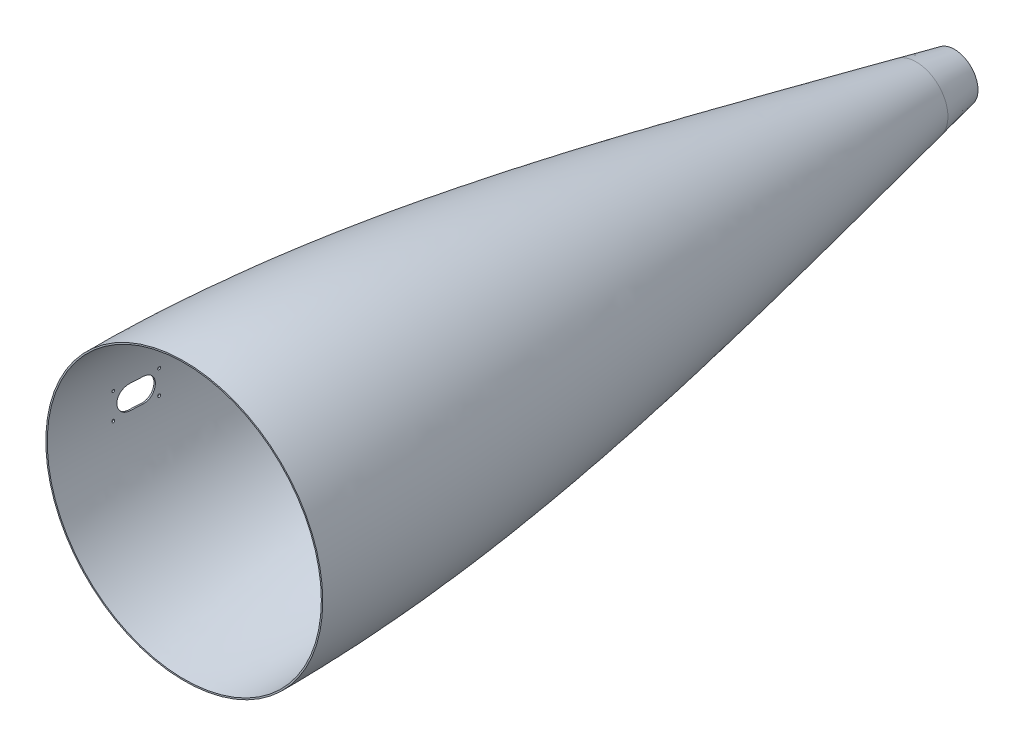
ISO-10303-21;
HEADER;
FILE_DESCRIPTION(('STEP AP214'),'2;1');
FILE_NAME('part.step','',(''),(''),'','','');
FILE_SCHEMA(('AUTOMOTIVE_DESIGN { 1 0 10303 214 1 1 1 1 }'));
ENDSEC;
DATA;
#1=APPLICATION_CONTEXT('core data for automotive mechanical design processes');
#2=APPLICATION_PROTOCOL_DEFINITION('international standard','automotive_design',2000,#1);
#3=PRODUCT_CONTEXT('',#1,'mechanical');
#4=PRODUCT('Part','Part','',(#3));
#5=PRODUCT_RELATED_PRODUCT_CATEGORY('part','',(#4));
#6=PRODUCT_DEFINITION_FORMATION('','',#4);
#7=PRODUCT_DEFINITION_CONTEXT('part definition',#1,'design');
#8=PRODUCT_DEFINITION('design','',#6,#7);
#9=PRODUCT_DEFINITION_SHAPE('','',#8);
#10=(LENGTH_UNIT() NAMED_UNIT(*) SI_UNIT(.MILLI.,.METRE.));
#11=(NAMED_UNIT(*) PLANE_ANGLE_UNIT() SI_UNIT($,.RADIAN.));
#12=(NAMED_UNIT(*) SI_UNIT($,.STERADIAN.) SOLID_ANGLE_UNIT());
#13=UNCERTAINTY_MEASURE_WITH_UNIT(LENGTH_MEASURE(1.E-05),#10,'distance_accuracy_value','');
#14=(GEOMETRIC_REPRESENTATION_CONTEXT(3) GLOBAL_UNCERTAINTY_ASSIGNED_CONTEXT((#13)) GLOBAL_UNIT_ASSIGNED_CONTEXT((#10,
#11,#12)) REPRESENTATION_CONTEXT('',''));
#15=CARTESIAN_POINT('',(0.,0.,0.));
#16=DIRECTION('',(0.,0.,1.));
#17=DIRECTION('',(1.,0.,0.));
#18=AXIS2_PLACEMENT_3D('',#15,#16,#17);
#19=CARTESIAN_POINT('',(0.,42.4307,-981.949776));
#20=CARTESIAN_POINT('',(0.,44.3940274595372,-972.702929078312));
#21=CARTESIAN_POINT('',(0.,52.2398427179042,-935.75083923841));
#22=CARTESIAN_POINT('',(0.,54.4301598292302,-925.45546085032));
#23=CARTESIAN_POINT('',(0.,65.0768416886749,-874.629330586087));
#24=CARTESIAN_POINT('',(0.,62.5369455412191,-886.87943453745));
#25=CARTESIAN_POINT('',(0.,70.2530984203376,-850.130733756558));
#26=CARTESIAN_POINT('',(0.,74.8513614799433,-828.154964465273));
#27=CARTESIAN_POINT('',(0.,80.4517455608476,-801.261495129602));
#28=CARTESIAN_POINT('',(0.,85.7601884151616,-775.688970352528));
#29=CARTESIAN_POINT('',(0.,91.0800474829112,-749.759326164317));
#30=CARTESIAN_POINT('',(0.,96.3431472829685,-723.928822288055));
#31=CARTESIAN_POINT('',(0.,101.515789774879,-698.0653898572));
#32=CARTESIAN_POINT('',(0.,106.653592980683,-672.215849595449));
#33=CARTESIAN_POINT('',(0.,111.712412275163,-646.363700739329));
#34=CARTESIAN_POINT('',(0.,116.664694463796,-620.509304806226));
#35=CARTESIAN_POINT('',(0.,121.514865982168,-594.654695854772));
#36=CARTESIAN_POINT('',(0.,126.270444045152,-568.803022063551));
#37=CARTESIAN_POINT('',(0.,130.895297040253,-542.948879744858));
#38=CARTESIAN_POINT('',(0.,135.377739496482,-517.090609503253));
#39=CARTESIAN_POINT('',(0.,139.799490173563,-491.245323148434));
#40=CARTESIAN_POINT('',(0.,143.991595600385,-465.383717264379));
#41=CARTESIAN_POINT('',(0.,148.102728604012,-439.535469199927));
#42=CARTESIAN_POINT('',(0.,152.000995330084,-413.67730240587));
#43=CARTESIAN_POINT('',(0.,155.768126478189,-387.825162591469));
#44=CARTESIAN_POINT('',(0.,159.356197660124,-361.972399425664));
#45=CARTESIAN_POINT('',(0.,162.725165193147,-336.115130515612));
#46=CARTESIAN_POINT('',(0.,165.932265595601,-310.262278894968));
#47=CARTESIAN_POINT('',(0.,168.937439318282,-284.409083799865));
#48=CARTESIAN_POINT('',(0.,171.693272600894,-258.551706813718));
#49=CARTESIAN_POINT('',(0.,174.27794790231,-232.700219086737));
#50=CARTESIAN_POINT('',(0.,176.576009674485,-206.842827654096));
#51=CARTESIAN_POINT('',(0.,178.668992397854,-180.989177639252));
#52=CARTESIAN_POINT('',(0.,180.496574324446,-155.13343033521));
#53=CARTESIAN_POINT('',(0.,182.067102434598,-129.278304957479));
#54=CARTESIAN_POINT('',(0.,183.407091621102,-103.422680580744));
#55=CARTESIAN_POINT('',(0.,184.402060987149,-77.5717563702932));
#56=CARTESIAN_POINT('',(0.,185.179084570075,-51.6933551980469));
#57=CARTESIAN_POINT('',(0.,185.648469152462,-25.9262408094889));
#58=CARTESIAN_POINT('',(0.,185.707824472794,-8.46685630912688));
#59=CARTESIAN_POINT('',(0.,185.7375,0.));
#60=B_SPLINE_CURVE_WITH_KNOTS('',3,(#19,#20,#21,#22,#23,#24,#25,#26,#27,#28,#29,#30,#31,#32,#33,
#34,#35,#36,#37,#38,#39,#40,#41,#42,#43,#44,#45,#46,#47,#48,#49,#50,#51,#52,#53,#54,#55,#56,#57,
#58,#59),.UNSPECIFIED.,.F.,.F.,(4,1,1,1,1,1,1,1,1,1,1,1,1,1,1,1,1,1,1,1,1,1,1,1,1,1,1,1,1,1,1,1,
1,1,1,1,1,1,4),(0.,0.000517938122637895,0.00206977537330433,0.00768948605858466,
0.0288679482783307,0.0577358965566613,0.0865979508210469,0.115454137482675,0.144304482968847,
0.173143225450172,0.20197047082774,0.230780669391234,0.259579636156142,0.28836195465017,
0.317122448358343,0.345861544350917,0.374579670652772,0.403272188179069,0.431939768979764,
0.460587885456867,0.489202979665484,0.517795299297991,0.546356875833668,0.574893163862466,
0.603401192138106,0.631878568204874,0.660330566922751,0.688755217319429,0.717151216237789,
0.745523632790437,0.773869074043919,0.802192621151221,0.830494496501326,0.858777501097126,
0.887044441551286,0.915295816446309,0.943537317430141,0.971770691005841,1.),.UNSPECIFIED.);
#61=CARTESIAN_POINT('',(0.,0.,0.));
#62=DIRECTION('',(0.,0.,1.));
#63=AXIS1_PLACEMENT('',#61,#62);
#64=SURFACE_OF_REVOLUTION('',#60,#63);
#65=CARTESIAN_POINT('',(-183.044214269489,19.3294,-86.0679));
#66=CARTESIAN_POINT('',(-183.040305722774,19.3293953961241,-86.1721195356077));
#67=CARTESIAN_POINT('',(-183.037310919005,19.3206432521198,-86.2764473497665));
#68=CARTESIAN_POINT('',(-183.033236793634,19.2858241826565,-86.4822972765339));
#69=CARTESIAN_POINT('',(-183.032159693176,19.2597372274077,-86.5838160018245));
#70=CARTESIAN_POINT('',(-183.031936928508,19.1909818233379,-86.7810355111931));
#71=CARTESIAN_POINT('',(-183.032790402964,19.1483207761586,-86.8767388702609));
#72=CARTESIAN_POINT('',(-183.036370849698,19.0476467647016,-87.0596259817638));
#73=CARTESIAN_POINT('',(-183.03909738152,18.989637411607,-87.1468117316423));
#74=CARTESIAN_POINT('',(-183.04630562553,18.8599101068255,-87.310256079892));
#75=CARTESIAN_POINT('',(-183.050787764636,18.7881888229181,-87.3865120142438));
#76=CARTESIAN_POINT('',(-183.06133543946,18.6330940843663,-87.5259467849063));
#77=CARTESIAN_POINT('',(-183.0674010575,18.549720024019,-87.5891249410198));
#78=CARTESIAN_POINT('',(-183.080925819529,18.373366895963,-87.7008645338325));
#79=CARTESIAN_POINT('',(-183.088389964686,18.2803539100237,-87.7493718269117));
#80=CARTESIAN_POINT('',(-183.10444912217,18.0876130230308,-87.8301338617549));
#81=CARTESIAN_POINT('',(-183.113044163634,17.9878849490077,-87.8623881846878));
#82=CARTESIAN_POINT('',(-183.131144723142,17.7839835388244,-87.9099041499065));
#83=CARTESIAN_POINT('',(-183.140654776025,17.6797896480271,-87.9250758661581));
#84=CARTESIAN_POINT('',(-183.160265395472,17.470388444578,-87.9377279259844));
#85=CARTESIAN_POINT('',(-183.170365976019,17.3651811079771,-87.9352078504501));
#86=CARTESIAN_POINT('',(-183.190919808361,17.1562542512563,-87.9125186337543));
#87=CARTESIAN_POINT('',(-183.201374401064,17.0525431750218,-87.8922729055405));
#88=CARTESIAN_POINT('',(-183.222314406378,16.8500126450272,-87.8346091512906));
#89=CARTESIAN_POINT('',(-183.23279981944,16.7511932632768,-87.7971908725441));
#90=CARTESIAN_POINT('',(-183.253551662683,16.5610749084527,-87.7061540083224));
#91=CARTESIAN_POINT('',(-183.263817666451,16.4697897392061,-87.6525064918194));
#92=CARTESIAN_POINT('',(-183.283856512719,16.2975453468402,-87.5305454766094));
#93=CARTESIAN_POINT('',(-183.293629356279,16.2165861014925,-87.4622320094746));
#94=CARTESIAN_POINT('',(-183.312434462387,16.0674047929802,-87.3129492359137));
#95=CARTESIAN_POINT('',(-183.321467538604,15.9991686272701,-87.2319941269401));
#96=CARTESIAN_POINT('',(-183.338588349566,15.8772993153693,-87.0596617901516));
#97=CARTESIAN_POINT('',(-183.346676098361,15.8236659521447,-86.9682847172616));
#98=CARTESIAN_POINT('',(-183.36168527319,15.7327254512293,-86.7780241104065));
#99=CARTESIAN_POINT('',(-183.368610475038,15.6953648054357,-86.6791664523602));
#100=CARTESIAN_POINT('',(-183.381155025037,15.6378182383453,-86.4764930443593));
#101=CARTESIAN_POINT('',(-183.386774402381,15.6176319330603,-86.3726774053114));
#102=CARTESIAN_POINT('',(-183.396539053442,15.5950968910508,-86.1635041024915));
#103=CARTESIAN_POINT('',(-183.400690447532,15.5926732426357,-86.058154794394));
#104=CARTESIAN_POINT('',(-183.407433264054,15.6055649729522,-85.8484966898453));
#105=CARTESIAN_POINT('',(-183.410024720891,15.6208799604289,-85.7441878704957));
#106=CARTESIAN_POINT('',(-183.413553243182,15.6687411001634,-85.5399769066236));
#107=CARTESIAN_POINT('',(-183.414496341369,15.7012238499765,-85.4400600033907));
#108=CARTESIAN_POINT('',(-183.414694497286,15.7824632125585,-85.2470758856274));
#109=CARTESIAN_POINT('',(-183.413949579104,15.8312195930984,-85.1540085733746));
#110=CARTESIAN_POINT('',(-183.410761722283,15.9435100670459,-84.9775311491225));
#111=CARTESIAN_POINT('',(-183.408321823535,16.0070175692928,-84.8941040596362));
#112=CARTESIAN_POINT('',(-183.401777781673,16.147039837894,-84.739069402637));
#113=CARTESIAN_POINT('',(-183.397673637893,16.2235546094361,-84.6674618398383));
#114=CARTESIAN_POINT('',(-183.387873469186,16.3874816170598,-84.538008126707));
#115=CARTESIAN_POINT('',(-183.382175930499,16.4749041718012,-84.4801751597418));
#116=CARTESIAN_POINT('',(-183.369316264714,16.6580959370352,-84.3799571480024));
#117=CARTESIAN_POINT('',(-183.36215411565,16.7538652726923,-84.3375723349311));
#118=CARTESIAN_POINT('',(-183.346510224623,16.9514002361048,-84.2692745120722));
#119=CARTESIAN_POINT('',(-183.33802374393,17.0531865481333,-84.243422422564));
#120=CARTESIAN_POINT('',(-183.319972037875,17.2595565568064,-84.2091176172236));
#121=CARTESIAN_POINT('',(-183.310406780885,17.3641403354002,-84.2006654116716));
#122=CARTESIAN_POINT('',(-183.290409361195,17.5737087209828,-84.2013566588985));
#123=CARTESIAN_POINT('',(-183.279973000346,17.6786926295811,-84.2105906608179));
#124=CARTESIAN_POINT('',(-183.258578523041,17.8855691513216,-84.2465401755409));
#125=CARTESIAN_POINT('',(-183.247620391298,17.9874616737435,-84.273256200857));
#126=CARTESIAN_POINT('',(-183.225462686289,18.1857325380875,-84.3435561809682));
#127=CARTESIAN_POINT('',(-183.214262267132,18.2820848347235,-84.3872133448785));
#128=CARTESIAN_POINT('',(-183.19201618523,18.4660628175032,-84.4901522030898));
#129=CARTESIAN_POINT('',(-183.180970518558,18.5536887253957,-84.5494335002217));
#130=CARTESIAN_POINT('',(-183.159374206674,18.7178233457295,-84.6820346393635));
#131=CARTESIAN_POINT('',(-183.148824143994,18.7943191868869,-84.7553705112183));
#132=CARTESIAN_POINT('',(-183.128575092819,18.9338907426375,-84.9139995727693));
#133=CARTESIAN_POINT('',(-183.118876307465,18.9969632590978,-84.9992956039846));
#134=CARTESIAN_POINT('',(-183.100676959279,19.1076906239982,-85.179194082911));
#135=CARTESIAN_POINT('',(-183.092173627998,19.1553814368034,-85.2737741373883));
#136=CARTESIAN_POINT('',(-183.07662816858,19.2340907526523,-85.4696556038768));
#137=CARTESIAN_POINT('',(-183.069584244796,19.2651298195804,-85.5709485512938));
#138=CARTESIAN_POINT('',(-183.059501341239,19.3013437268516,-85.7387319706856));
#139=CARTESIAN_POINT('',(-183.055949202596,19.3118489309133,-85.8040891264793));
#140=CARTESIAN_POINT('',(-183.049546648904,19.3258785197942,-85.9355829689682));
#141=CARTESIAN_POINT('',(-183.046696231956,19.3294029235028,-86.0017196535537));
#142=CARTESIAN_POINT('',(-183.044214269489,19.3294,-86.0679));
#143=B_SPLINE_CURVE_WITH_KNOTS('',3,(#65,#66,#67,#68,#69,#70,#71,#72,#73,#74,#75,#76,#77,#78,
#79,#80,#81,#82,#83,#84,#85,#86,#87,#88,#89,#90,#91,#92,#93,#94,#95,#96,#97,#98,#99,#100,#101,
#102,#103,#104,#105,#106,#107,#108,#109,#110,#111,#112,#113,#114,#115,#116,#117,#118,#119,#120,
#121,#122,#123,#124,#125,#126,#127,#128,#129,#130,#131,#132,#133,#134,#135,#136,#137,#138,#139,
#140,#141,#142),.UNSPECIFIED.,.T.,.F.,(4,2,2,2,2,2,2,2,2,2,2,2,2,2,2,2,2,2,2,2,2,2,2,2,2,2,2,2,
2,2,2,2,2,2,2,2,2,2,4),(0.,0.312637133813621,0.625636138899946,0.938495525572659,
1.25128136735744,1.56414331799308,1.87702153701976,2.19104074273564,2.50506804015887,
2.82074081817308,3.13642107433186,3.45347205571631,3.77052770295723,4.0881519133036,
4.40577543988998,4.72304478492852,5.04030941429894,5.35652278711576,5.67272908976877,
5.98760106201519,6.30246608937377,6.61617632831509,6.92988209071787,7.24302667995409,
7.55617139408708,7.86961461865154,8.18306254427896,8.49765891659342,8.81226451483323,
9.1284851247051,9.44471500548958,9.76232693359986,10.0799307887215,10.3978990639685,
10.715943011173,11.033237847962,11.3501399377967,11.5486678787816,11.7471952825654),.UNSPECIFIED.);
#144=CARTESIAN_POINT('',(-183.044214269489,19.3294,-86.0679));
#145=VERTEX_POINT('',#144);
#146=EDGE_CURVE('E106',#145,#145,#143,.T.);
#147=ORIENTED_EDGE('',*,*,#146,.F.);
#148=EDGE_LOOP('',(#147));
#149=FACE_BOUND('',#148,.T.);
#150=CARTESIAN_POINT('',(0.,0.,-981.949776));
#151=DIRECTION('',(0.,0.,1.));
#152=DIRECTION('',(1.,0.,0.));
#153=AXIS2_PLACEMENT_3D('',#150,#151,#152);
#154=CIRCLE('',#153,42.4307);
#155=CARTESIAN_POINT('',(42.4307,0.,-981.949776));
#156=VERTEX_POINT('',#155);
#157=EDGE_CURVE('E195',#156,#156,#154,.T.);
#158=ORIENTED_EDGE('',*,*,#157,.T.);
#159=EDGE_LOOP('',(#158));
#160=FACE_BOUND('',#159,.T.);
#161=CARTESIAN_POINT('',(0.,0.,0.));
#162=DIRECTION('',(0.,0.,1.));
#163=DIRECTION('',(1.,0.,0.));
#164=AXIS2_PLACEMENT_3D('',#161,#162,#163);
#165=CIRCLE('',#164,185.7375);
#166=CARTESIAN_POINT('',(185.7375,0.,0.));
#167=VERTEX_POINT('',#166);
#168=EDGE_CURVE('E171',#167,#167,#165,.T.);
#169=ORIENTED_EDGE('',*,*,#168,.F.);
#170=EDGE_LOOP('',(#169));
#171=FACE_BOUND('',#170,.T.);
#172=CARTESIAN_POINT('',(-182.479589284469,-15.875,-107.3404));
#173=CARTESIAN_POINT('',(-182.490166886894,-15.8749998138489,-107.116788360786));
#174=CARTESIAN_POINT('',(-182.50111763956,-15.8702746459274,-106.89322194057));
#175=CARTESIAN_POINT('',(-182.523742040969,-15.8513911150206,-106.446525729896));
#176=CARTESIAN_POINT('',(-182.53541568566,-15.8372328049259,-106.223395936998));
#177=CARTESIAN_POINT('',(-182.571478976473,-15.7806443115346,-105.555307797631));
#178=CARTESIAN_POINT('',(-182.596917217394,-15.7241005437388,-105.111518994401));
#179=CARTESIAN_POINT('',(-182.65026719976,-15.5738847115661,-104.230871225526));
#180=CARTESIAN_POINT('',(-182.678176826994,-15.4802441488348,-103.794006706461));
#181=CARTESIAN_POINT('',(-182.73612877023,-15.2565316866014,-102.929839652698));
#182=CARTESIAN_POINT('',(-182.766171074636,-15.1264599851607,-102.502537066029));
#183=CARTESIAN_POINT('',(-182.827977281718,-14.8307848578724,-101.660374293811));
#184=CARTESIAN_POINT('',(-182.85974177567,-14.6651691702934,-101.245518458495));
#185=CARTESIAN_POINT('',(-182.924501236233,-14.2996232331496,-100.431309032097));
#186=CARTESIAN_POINT('',(-182.957496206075,-14.099692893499,-100.031955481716));
#187=CARTESIAN_POINT('',(-183.024180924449,-13.6669658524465,-99.2515992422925));
#188=CARTESIAN_POINT('',(-183.057870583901,-13.4341733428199,-98.8705942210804));
#189=CARTESIAN_POINT('',(-183.12538001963,-12.9373415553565,-98.1295467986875));
#190=CARTESIAN_POINT('',(-183.159199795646,-12.6733023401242,-97.7695043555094));
#191=CARTESIAN_POINT('',(-183.226469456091,-12.1150491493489,-97.0719374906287));
#192=CARTESIAN_POINT('',(-183.259918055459,-11.8207535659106,-96.7344782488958));
#193=CARTESIAN_POINT('',(-183.325740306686,-11.2046586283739,-96.0855602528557));
#194=CARTESIAN_POINT('',(-183.358113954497,-10.8828591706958,-95.7741015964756));
#195=CARTESIAN_POINT('',(-183.421184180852,-10.2139648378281,-95.1793614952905));
#196=CARTESIAN_POINT('',(-183.451880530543,-9.86686652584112,-94.8960838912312));
#197=CARTESIAN_POINT('',(-183.51100236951,-9.14984970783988,-94.3597873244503));
#198=CARTESIAN_POINT('',(-183.539427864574,-8.77993126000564,-94.1067682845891));
#199=CARTESIAN_POINT('',(-183.59341812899,-8.02034561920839,-93.6331112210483));
#200=CARTESIAN_POINT('',(-183.618986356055,-7.63070314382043,-93.4124339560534));
#201=CARTESIAN_POINT('',(-183.666793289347,-6.83400793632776,-93.0047032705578));
#202=CARTESIAN_POINT('',(-183.689031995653,-6.42695520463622,-92.817649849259));
#203=CARTESIAN_POINT('',(-183.729728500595,-5.5983752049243,-92.4785635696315));
#204=CARTESIAN_POINT('',(-183.748186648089,-5.1768492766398,-92.326527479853));
#205=CARTESIAN_POINT('',(-183.78094663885,-4.32230859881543,-92.0585880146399));
#206=CARTESIAN_POINT('',(-183.795248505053,-3.88929391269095,-91.9426844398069));
#207=CARTESIAN_POINT('',(-183.81932188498,-3.01773459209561,-91.7485130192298));
#208=CARTESIAN_POINT('',(-183.82912217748,-2.57924403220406,-91.6700059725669));
#209=CARTESIAN_POINT('',(-183.844126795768,-1.69714034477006,-91.5501036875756));
#210=CARTESIAN_POINT('',(-183.849331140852,-1.25352723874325,-91.5087082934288));
#211=CARTESIAN_POINT('',(-183.855036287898,-0.364364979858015,-91.4633401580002));
#212=CARTESIAN_POINT('',(-183.855537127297,0.0811841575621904,-91.4593671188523));
#213=CARTESIAN_POINT('',(-183.851824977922,0.97102035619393,-91.4888728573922));
#214=CARTESIAN_POINT('',(-183.847611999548,1.41530742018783,-91.5223515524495));
#215=CARTESIAN_POINT('',(-183.834591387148,2.29726623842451,-91.6262537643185));
#216=CARTESIAN_POINT('',(-183.825806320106,2.7349597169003,-91.696495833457));
#217=CARTESIAN_POINT('',(-183.803834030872,3.60283468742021,-91.8732954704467));
#218=CARTESIAN_POINT('',(-183.790646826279,4.0330162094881,-91.979852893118));
#219=CARTESIAN_POINT('',(-183.760137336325,4.88283462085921,-92.2284988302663));
#220=CARTESIAN_POINT('',(-183.742815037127,5.30247147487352,-92.3705874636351));
#221=CARTESIAN_POINT('',(-183.704382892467,6.12825729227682,-92.6892581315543));
#222=CARTESIAN_POINT('',(-183.683273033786,6.53440620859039,-92.8658402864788));
#223=CARTESIAN_POINT('',(-183.637628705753,7.33135360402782,-93.2526907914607));
#224=CARTESIAN_POINT('',(-183.61308603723,7.72211237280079,-93.4630399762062));
#225=CARTESIAN_POINT('',(-183.56109674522,8.4845145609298,-93.9156036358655));
#226=CARTESIAN_POINT('',(-183.533650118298,8.85615795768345,-94.1578181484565));
#227=CARTESIAN_POINT('',(-183.476382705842,9.57775523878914,-94.6723852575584));
#228=CARTESIAN_POINT('',(-183.446561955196,9.92770944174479,-94.9447374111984));
#229=CARTESIAN_POINT('',(-183.385109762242,10.6035267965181,-95.5176638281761));
#230=CARTESIAN_POINT('',(-183.353478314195,10.9293898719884,-95.8182381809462));
#231=CARTESIAN_POINT('',(-183.288772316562,11.556892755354,-96.4476203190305));
#232=CARTESIAN_POINT('',(-183.25568949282,11.8583549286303,-96.7766043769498));
#233=CARTESIAN_POINT('',(-183.18888451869,12.4325019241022,-97.4587371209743));
#234=CARTESIAN_POINT('',(-183.155162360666,12.7051864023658,-97.8118860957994));
#235=CARTESIAN_POINT('',(-183.087664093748,13.2199624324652,-98.5399980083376));
#236=CARTESIAN_POINT('',(-183.053887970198,13.4620433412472,-98.914968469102));
#237=CARTESIAN_POINT('',(-182.986870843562,13.9137973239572,-99.6839831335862));
#238=CARTESIAN_POINT('',(-182.953629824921,14.123471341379,-100.078026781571));
#239=CARTESIAN_POINT('',(-182.888083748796,14.5097695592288,-100.884171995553));
#240=CARTESIAN_POINT('',(-182.855783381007,14.6862463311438,-101.296344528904));
#241=CARTESIAN_POINT('',(-182.792769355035,15.0037594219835,-102.134297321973));
#242=CARTESIAN_POINT('',(-182.762055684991,15.1447960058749,-102.560077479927));
#243=CARTESIAN_POINT('',(-182.717535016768,15.3288899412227,-103.20628607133));
#244=CARTESIAN_POINT('',(-182.702959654,15.3856573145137,-103.422840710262));
#245=CARTESIAN_POINT('',(-182.674367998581,15.4899819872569,-103.858135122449));
#246=CARTESIAN_POINT('',(-182.660351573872,15.5375414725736,-104.076874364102));
#247=CARTESIAN_POINT('',(-182.619216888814,15.6662475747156,-104.735712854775));
#248=CARTESIAN_POINT('',(-182.592995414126,15.7334952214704,-105.17869054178));
#249=CARTESIAN_POINT('',(-182.552211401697,15.8129304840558,-105.908883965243));
#250=CARTESIAN_POINT('',(-182.536843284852,15.836218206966,-106.194914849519));
#251=CARTESIAN_POINT('',(-182.507309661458,15.8672410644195,-106.767406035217));
#252=CARTESIAN_POINT('',(-182.493142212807,15.8750017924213,-107.053864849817));
#253=CARTESIAN_POINT('',(-182.479589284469,15.875,-107.3404));
#254=B_SPLINE_CURVE_WITH_KNOTS('',3,(#172,#173,#174,#175,#176,#177,#178,#179,#180,#181,#182,
#183,#184,#185,#186,#187,#188,#189,#190,#191,#192,#193,#194,#195,#196,#197,#198,#199,#200,#201,
#202,#203,#204,#205,#206,#207,#208,#209,#210,#211,#212,#213,#214,#215,#216,#217,#218,#219,#220,
#221,#222,#223,#224,#225,#226,#227,#228,#229,#230,#231,#232,#233,#234,#235,#236,#237,#238,#239,
#240,#241,#242,#243,#244,#245,#246,#247,#248,#249,#250,#251,#252,#253),.UNSPECIFIED.,.F.,.F.,(4,
2,2,2,2,2,2,2,2,2,2,2,2,2,2,2,2,2,2,2,2,2,2,2,2,2,2,2,2,2,2,2,2,2,2,2,2,2,2,2,4),(0.,
0.67147999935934,1.34295623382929,2.68551445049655,4.02693503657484,5.36834833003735,
6.71022512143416,8.05210543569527,9.3938147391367,10.7355213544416,12.0809468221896,
13.4263773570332,14.7719910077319,16.1176012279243,17.461565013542,18.8055287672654,
20.1493684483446,21.4932007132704,22.828317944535,24.1634295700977,25.4985305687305,
26.8336286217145,28.1621985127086,29.4907630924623,30.8193321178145,32.1479057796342,
33.4797086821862,34.811513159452,36.1432980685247,37.4750871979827,38.8158324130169,
40.1565936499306,41.49781989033,42.839007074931,44.1860166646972,45.5330161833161,
46.2058772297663,46.8785783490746,48.2231775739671,49.0849664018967,49.945333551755),.UNSPECIFIED.);
#255=CARTESIAN_POINT('',(-182.479589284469,-15.875,-107.3404));
#256=VERTEX_POINT('',#255);
#257=CARTESIAN_POINT('',(-182.479589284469,15.875,-107.3404));
#258=VERTEX_POINT('',#257);
#259=EDGE_CURVE('E94',#256,#258,#254,.T.);
#260=ORIENTED_EDGE('',*,*,#259,.F.);
#261=CARTESIAN_POINT('',(-181.584404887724,-15.875,-124.8029));
#262=CARTESIAN_POINT('',(-181.637639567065,-15.875,-123.832942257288));
#263=CARTESIAN_POINT('',(-181.690345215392,-15.875,-122.862955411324));
#264=CARTESIAN_POINT('',(-181.794643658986,-15.875,-120.922924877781));
#265=CARTESIAN_POINT('',(-181.846236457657,-15.875,-119.952881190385));
#266=CARTESIAN_POINT('',(-181.948254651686,-15.875,-118.012734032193));
#267=CARTESIAN_POINT('',(-181.998680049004,-15.875,-117.042630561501));
#268=CARTESIAN_POINT('',(-182.098308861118,-15.875,-115.10236067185));
#269=CARTESIAN_POINT('',(-182.147512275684,-15.875,-114.132194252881));
#270=CARTESIAN_POINT('',(-182.24464247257,-15.875,-112.191796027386));
#271=CARTESIAN_POINT('',(-182.292569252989,-15.875,-111.221564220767));
#272=CARTESIAN_POINT('',(-182.38709149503,-15.875,-109.281032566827));
#273=CARTESIAN_POINT('',(-182.433686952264,-15.875,-108.310732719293));
#274=CARTESIAN_POINT('',(-182.479589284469,-15.875,-107.3404));
#275=B_SPLINE_CURVE_WITH_KNOTS('',3,(#261,#262,#263,#264,#265,#266,#267,#268,#269,#270,#271,
#272,#273,#274),.UNSPECIFIED.,.F.,.F.,(4,2,2,2,2,2,4),(0.,2.91425244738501,5.82849597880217,
8.74273461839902,11.6569738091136,14.5712173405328,17.4854704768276),.UNSPECIFIED.);
#276=CARTESIAN_POINT('',(-181.584404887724,-15.875,-124.8029));
#277=VERTEX_POINT('',#276);
#278=EDGE_CURVE('E83',#277,#256,#275,.T.);
#279=ORIENTED_EDGE('',*,*,#278,.F.);
#280=CARTESIAN_POINT('',(-181.584404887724,15.875,-124.8029));
#281=CARTESIAN_POINT('',(-181.568123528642,15.8750095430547,-125.099496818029));
#282=CARTESIAN_POINT('',(-181.552523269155,15.8666882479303,-125.396130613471));
#283=CARTESIAN_POINT('',(-181.522718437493,15.8334406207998,-125.988525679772));
#284=CARTESIAN_POINT('',(-181.508513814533,15.8085148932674,-126.284286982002));
#285=CARTESIAN_POINT('',(-181.481532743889,15.7421155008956,-126.874008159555));
#286=CARTESIAN_POINT('',(-181.468756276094,15.7006420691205,-127.167968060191));
#287=CARTESIAN_POINT('',(-181.444651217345,15.6013081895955,-127.752943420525));
#288=CARTESIAN_POINT('',(-181.433321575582,15.5434597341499,-128.043960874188));
#289=CARTESIAN_POINT('',(-181.412094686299,15.4115354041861,-128.622347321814));
#290=CARTESIAN_POINT('',(-181.402197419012,15.3374597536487,-128.909716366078));
#291=CARTESIAN_POINT('',(-181.383813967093,15.173316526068,-129.479877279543));
#292=CARTESIAN_POINT('',(-181.375327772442,15.0832490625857,-129.762669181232));
#293=CARTESIAN_POINT('',(-181.355823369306,14.8383574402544,-130.46301632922));
#294=CARTESIAN_POINT('',(-181.345663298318,14.673682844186,-130.87719072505));
#295=CARTESIAN_POINT('',(-181.328243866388,14.3100345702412,-131.690346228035));
#296=CARTESIAN_POINT('',(-181.320984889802,14.1110563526,-132.089325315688));
#297=CARTESIAN_POINT('',(-181.312079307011,13.7880181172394,-132.674101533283));
#298=CARTESIAN_POINT('',(-181.309441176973,13.6762373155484,-132.866754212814));
#299=CARTESIAN_POINT('',(-181.304787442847,13.4447020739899,-133.24713915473));
#300=CARTESIAN_POINT('',(-181.302771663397,13.3249498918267,-133.434872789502));
#301=CARTESIAN_POINT('',(-181.297597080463,12.9539720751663,-133.990305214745));
#302=CARTESIAN_POINT('',(-181.295310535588,12.6910065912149,-134.350269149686));
#303=CARTESIAN_POINT('',(-181.292712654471,12.1358235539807,-135.046715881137));
#304=CARTESIAN_POINT('',(-181.292400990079,11.843610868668,-135.383202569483));
#305=CARTESIAN_POINT('',(-181.293367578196,11.2319306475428,-136.030437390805));
#306=CARTESIAN_POINT('',(-181.294645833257,10.9124630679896,-136.341185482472));
#307=CARTESIAN_POINT('',(-181.298394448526,10.2484928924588,-136.934773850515));
#308=CARTESIAN_POINT('',(-181.300865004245,9.90398619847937,-137.217609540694));
#309=CARTESIAN_POINT('',(-181.30659867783,9.19242077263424,-137.753318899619));
#310=CARTESIAN_POINT('',(-181.309861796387,8.82536202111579,-138.006192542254));
#311=CARTESIAN_POINT('',(-181.316799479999,8.07066752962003,-138.480580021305));
#312=CARTESIAN_POINT('',(-181.320474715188,7.68299883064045,-138.702041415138));
#313=CARTESIAN_POINT('',(-181.327869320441,6.8903916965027,-139.111537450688));
#314=CARTESIAN_POINT('',(-181.331588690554,6.48545324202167,-139.299572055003));
#315=CARTESIAN_POINT('',(-181.338746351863,5.66120673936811,-139.640868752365));
#316=CARTESIAN_POINT('',(-181.342184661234,5.24189962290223,-139.794133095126));
#317=CARTESIAN_POINT('',(-181.34850417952,4.39186665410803,-140.064816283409));
#318=CARTESIAN_POINT('',(-181.351385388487,3.96114080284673,-140.18223513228));
#319=CARTESIAN_POINT('',(-181.356373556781,3.09107063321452,-140.380451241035));
#320=CARTESIAN_POINT('',(-181.358480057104,2.65172136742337,-140.461226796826));
#321=CARTESIAN_POINT('',(-181.361762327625,1.76777614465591,-140.585478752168));
#322=CARTESIAN_POINT('',(-181.362938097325,1.3231801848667,-140.62895513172));
#323=CARTESIAN_POINT('',(-181.36427480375,0.431894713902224,-140.678299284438));
#324=CARTESIAN_POINT('',(-181.364435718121,-0.0147948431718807,-140.68416622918));
#325=CARTESIAN_POINT('',(-181.36373123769,-0.9070792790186,-140.658247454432));
#326=CARTESIAN_POINT('',(-181.362865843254,-1.35267415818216,-140.626461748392));
#327=CARTESIAN_POINT('',(-181.360170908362,-2.23943626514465,-140.525482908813));
#328=CARTESIAN_POINT('',(-181.358341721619,-2.68060505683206,-140.456303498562));
#329=CARTESIAN_POINT('',(-181.353851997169,-3.55554537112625,-140.281038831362));
#330=CARTESIAN_POINT('',(-181.35119145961,-3.98931689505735,-140.174953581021));
#331=CARTESIAN_POINT('',(-181.345238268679,-4.84638102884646,-139.926632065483));
#332=CARTESIAN_POINT('',(-181.341945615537,-5.26967364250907,-139.784395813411));
#333=CARTESIAN_POINT('',(-181.334987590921,-6.10277454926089,-139.464783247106));
#334=CARTESIAN_POINT('',(-181.331322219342,-6.51258283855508,-139.287406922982));
#335=CARTESIAN_POINT('',(-181.323928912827,-7.31590693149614,-138.898724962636));
#336=CARTESIAN_POINT('',(-181.320200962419,-7.70941862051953,-138.68741082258));
#337=CARTESIAN_POINT('',(-181.31303620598,-8.47724599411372,-138.232385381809));
#338=CARTESIAN_POINT('',(-181.309599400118,-8.85156166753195,-137.988674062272));
#339=CARTESIAN_POINT('',(-181.303399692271,-9.57832239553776,-137.470595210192));
#340=CARTESIAN_POINT('',(-181.300636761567,-9.93076838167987,-137.196228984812));
#341=CARTESIAN_POINT('',(-181.296184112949,-10.611300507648,-136.618782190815));
#342=CARTESIAN_POINT('',(-181.294494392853,-10.9393866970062,-136.315701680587));
#343=CARTESIAN_POINT('',(-181.292591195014,-11.5688278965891,-135.683016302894));
#344=CARTESIAN_POINT('',(-181.292377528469,-11.8701863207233,-135.35341483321));
#345=CARTESIAN_POINT('',(-181.293817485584,-12.444066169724,-134.670015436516));
#346=CARTESIAN_POINT('',(-181.295471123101,-12.7165873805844,-134.316217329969));
#347=CARTESIAN_POINT('',(-181.301014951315,-13.2309609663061,-133.586774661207));
#348=CARTESIAN_POINT('',(-181.304905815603,-13.4728040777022,-133.211123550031));
#349=CARTESIAN_POINT('',(-181.312662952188,-13.8111118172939,-132.63352256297));
#350=CARTESIAN_POINT('',(-181.315568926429,-13.9198079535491,-132.438628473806));
#351=CARTESIAN_POINT('',(-181.322057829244,-14.128915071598,-132.04439024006));
#352=CARTESIAN_POINT('',(-181.325640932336,-14.2293239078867,-131.845044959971));
#353=CARTESIAN_POINT('',(-181.33744755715,-14.5175873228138,-131.241373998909));
#354=CARTESIAN_POINT('',(-181.346734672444,-14.6927609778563,-130.830931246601));
#355=CARTESIAN_POINT('',(-181.368361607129,-15.0079135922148,-129.996830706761));
#356=CARTESIAN_POINT('',(-181.380701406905,-15.1478927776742,-129.573173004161));
#357=CARTESIAN_POINT('',(-181.40159282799,-15.3306569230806,-128.93038995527));
#358=CARTESIAN_POINT('',(-181.408949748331,-15.3870249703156,-128.715011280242));
#359=CARTESIAN_POINT('',(-181.424465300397,-15.490639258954,-128.282158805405));
#360=CARTESIAN_POINT('',(-181.432623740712,-15.5378876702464,-128.064685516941));
#361=CARTESIAN_POINT('',(-181.45830764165,-15.6658080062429,-127.409773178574));
#362=CARTESIAN_POINT('',(-181.477049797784,-15.7327263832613,-126.969590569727));
#363=CARTESIAN_POINT('',(-181.51058061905,-15.8123673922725,-126.240915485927));
#364=CARTESIAN_POINT('',(-181.524443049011,-15.8358721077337,-125.953493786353));
#365=CARTESIAN_POINT('',(-181.553459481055,-15.8671761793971,-125.378350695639));
#366=CARTESIAN_POINT('',(-181.568611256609,-15.8750020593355,-125.090630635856));
#367=CARTESIAN_POINT('',(-181.584404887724,-15.875,-124.8029));
#368=B_SPLINE_CURVE_WITH_KNOTS('',3,(#280,#281,#282,#283,#284,#285,#286,#287,#288,#289,#290,
#291,#292,#293,#294,#295,#296,#297,#298,#299,#300,#301,#302,#303,#304,#305,#306,#307,#308,#309,
#310,#311,#312,#313,#314,#315,#316,#317,#318,#319,#320,#321,#322,#323,#324,#325,#326,#327,#328,
#329,#330,#331,#332,#333,#334,#335,#336,#337,#338,#339,#340,#341,#342,#343,#344,#345,#346,#347,
#348,#349,#350,#351,#352,#353,#354,#355,#356,#357,#358,#359,#360,#361,#362,#363,#364,#365,#366,
#367),.UNSPECIFIED.,.F.,.F.,(4,2,2,2,2,2,2,2,2,2,2,2,2,2,2,2,2,2,2,2,2,2,2,2,2,2,2,2,2,2,2,2,2,
2,2,2,2,2,2,2,2,2,2,4),(0.,0.891012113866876,1.78199179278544,2.67295892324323,3.56327523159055,
4.45357925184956,5.34387695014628,6.67971138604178,8.01572274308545,8.68379560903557,
9.35168005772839,10.6873340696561,12.0227661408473,13.3582003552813,14.6938536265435,
16.029508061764,17.367366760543,18.7052269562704,20.0430005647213,21.3807740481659,
22.7193388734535,24.0579044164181,25.3964994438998,26.7350939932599,28.0731976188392,
29.4113010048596,30.749403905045,32.0875071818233,33.4259462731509,34.7643861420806,
36.1027689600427,37.441149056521,38.779357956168,40.1175767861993,41.4561987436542,
42.125551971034,42.795077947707,44.1324598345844,45.4698331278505,46.1379195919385,
46.8058468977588,48.1409204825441,49.0066792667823,49.8709722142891),.UNSPECIFIED.);
#369=CARTESIAN_POINT('',(-181.584404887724,15.875,-124.8029));
#370=VERTEX_POINT('',#369);
#371=EDGE_CURVE('E88',#370,#277,#368,.T.);
#372=ORIENTED_EDGE('',*,*,#371,.F.);
#373=CARTESIAN_POINT('',(-182.479589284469,15.875,-107.3404));
#374=CARTESIAN_POINT('',(-182.433686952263,15.875,-108.310732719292));
#375=CARTESIAN_POINT('',(-182.38709149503,15.875,-109.281032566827));
#376=CARTESIAN_POINT('',(-182.292569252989,15.875,-111.221564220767));
#377=CARTESIAN_POINT('',(-182.24464247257,15.875,-112.191796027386));
#378=CARTESIAN_POINT('',(-182.147512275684,15.875,-114.13219425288));
#379=CARTESIAN_POINT('',(-182.098308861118,15.875,-115.10236067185));
#380=CARTESIAN_POINT('',(-181.998680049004,15.875,-117.0426305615));
#381=CARTESIAN_POINT('',(-181.948254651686,15.875,-118.012734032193));
#382=CARTESIAN_POINT('',(-181.846236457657,15.875,-119.952881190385));
#383=CARTESIAN_POINT('',(-181.794643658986,15.875,-120.922924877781));
#384=CARTESIAN_POINT('',(-181.690345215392,15.875,-122.862955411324));
#385=CARTESIAN_POINT('',(-181.637639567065,15.875,-123.832942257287));
#386=CARTESIAN_POINT('',(-181.584404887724,15.875,-124.8029));
#387=B_SPLINE_CURVE_WITH_KNOTS('',3,(#373,#374,#375,#376,#377,#378,#379,#380,#381,#382,#383,
#384,#385,#386),.UNSPECIFIED.,.F.,.F.,(4,2,2,2,2,2,4),(0.,2.91425313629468,5.82849666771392,
8.7427358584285,11.6569744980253,14.5712180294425,17.4854704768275),.UNSPECIFIED.);
#388=EDGE_CURVE('E102',#258,#370,#387,.T.);
#389=ORIENTED_EDGE('',*,*,#388,.F.);
#390=EDGE_LOOP('',(#260,#279,#372,#389));
#391=FACE_BOUND('',#390,.T.);
#392=CARTESIAN_POINT('',(-183.400074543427,-15.5956,-86.0679));
#393=CARTESIAN_POINT('',(-183.396148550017,-15.5956047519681,-86.1727644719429));
#394=CARTESIAN_POINT('',(-183.391461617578,-15.6044657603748,-86.2776782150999));
#395=CARTESIAN_POINT('',(-183.380693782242,-15.6396580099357,-86.4845502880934));
#396=CARTESIAN_POINT('',(-183.374611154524,-15.6660109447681,-86.5865047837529));
#397=CARTESIAN_POINT('',(-183.361212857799,-15.7353930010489,-86.7844200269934));
#398=CARTESIAN_POINT('',(-183.353897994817,-15.7784112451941,-86.8803846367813));
#399=CARTESIAN_POINT('',(-183.338212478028,-15.8798589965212,-87.0636573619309));
#400=CARTESIAN_POINT('',(-183.329842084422,-15.9382847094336,-87.1509676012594));
#401=CARTESIAN_POINT('',(-183.312214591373,-16.0690812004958,-87.3147838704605));
#402=CARTESIAN_POINT('',(-183.30295477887,-16.1414953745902,-87.3912549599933));
#403=CARTESIAN_POINT('',(-183.283790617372,-16.2980837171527,-87.5309307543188));
#404=CARTESIAN_POINT('',(-183.27388622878,-16.3822586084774,-87.5941346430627));
#405=CARTESIAN_POINT('',(-183.253633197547,-16.5603218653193,-87.705725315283));
#406=CARTESIAN_POINT('',(-183.243283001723,-16.6542461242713,-87.7540545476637));
#407=CARTESIAN_POINT('',(-183.222432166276,-16.848874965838,-87.8342116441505));
#408=CARTESIAN_POINT('',(-183.211931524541,-16.949579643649,-87.8660392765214));
#409=CARTESIAN_POINT('',(-183.191029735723,-17.1551419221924,-87.9123430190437));
#410=CARTESIAN_POINT('',(-183.18062884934,-17.2600079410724,-87.9267818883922));
#411=CARTESIAN_POINT('',(-183.160233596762,-17.4707129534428,-87.9377602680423));
#412=CARTESIAN_POINT('',(-183.150239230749,-17.5765519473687,-87.9342997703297));
#413=CARTESIAN_POINT('',(-183.130950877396,-17.7861299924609,-87.9095586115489));
#414=CARTESIAN_POINT('',(-183.121656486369,-17.8898702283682,-87.888288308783));
#415=CARTESIAN_POINT('',(-183.10404583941,-18.0923483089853,-87.8285103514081));
#416=CARTESIAN_POINT('',(-183.095729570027,-18.1910862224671,-87.7900029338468));
#417=CARTESIAN_POINT('',(-183.080372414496,-18.3803881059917,-87.6969737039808));
#418=CARTESIAN_POINT('',(-183.073327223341,-18.4709791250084,-87.6425076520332));
#419=CARTESIAN_POINT('',(-183.060720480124,-18.6417541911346,-87.5190295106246));
#420=CARTESIAN_POINT('',(-183.055158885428,-18.7219385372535,-87.4500178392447));
#421=CARTESIAN_POINT('',(-183.045750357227,-18.8691855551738,-87.2997915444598));
#422=CARTESIAN_POINT('',(-183.041894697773,-18.9363139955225,-87.2186419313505));
#423=CARTESIAN_POINT('',(-183.036011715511,-19.0560184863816,-87.0461798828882));
#424=CARTESIAN_POINT('',(-183.033984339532,-19.1085949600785,-86.9548677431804));
#425=CARTESIAN_POINT('',(-183.03185984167,-19.1974671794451,-86.7651296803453));
#426=CARTESIAN_POINT('',(-183.031753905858,-19.233836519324,-86.6667383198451));
#427=CARTESIAN_POINT('',(-183.033480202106,-19.2896100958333,-86.4652767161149));
#428=CARTESIAN_POINT('',(-183.035312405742,-19.3090145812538,-86.3622065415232));
#429=CARTESIAN_POINT('',(-183.040871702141,-19.3303066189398,-86.1544877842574));
#430=CARTESIAN_POINT('',(-183.04459582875,-19.3322215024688,-86.0498419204));
#431=CARTESIAN_POINT('',(-183.053829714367,-19.3185854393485,-85.8417756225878));
#432=CARTESIAN_POINT('',(-183.059339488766,-19.3030343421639,-85.7383551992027));
#433=CARTESIAN_POINT('',(-183.071988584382,-19.2548872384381,-85.5353872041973));
#434=CARTESIAN_POINT('',(-183.079132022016,-19.2222479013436,-85.4358501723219));
#435=CARTESIAN_POINT('',(-183.094809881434,-19.1408666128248,-85.2437111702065));
#436=CARTESIAN_POINT('',(-183.103344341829,-19.0921242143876,-85.151109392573));
#437=CARTESIAN_POINT('',(-183.121577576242,-18.9796325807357,-84.974918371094));
#438=CARTESIAN_POINT('',(-183.131282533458,-18.9158017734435,-84.8913818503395));
#439=CARTESIAN_POINT('',(-183.151502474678,-18.7751089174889,-84.7362314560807));
#440=CARTESIAN_POINT('',(-183.162017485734,-18.6982464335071,-84.6646179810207));
#441=CARTESIAN_POINT('',(-183.18358133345,-18.5331901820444,-84.5349236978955));
#442=CARTESIAN_POINT('',(-183.19463286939,-18.4449343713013,-84.4769222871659));
#443=CARTESIAN_POINT('',(-183.216862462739,-18.2599330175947,-84.3766018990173));
#444=CARTESIAN_POINT('',(-183.228040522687,-18.1631873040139,-84.3342832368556));
#445=CARTESIAN_POINT('',(-183.250209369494,-17.9636365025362,-84.2664238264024));
#446=CARTESIAN_POINT('',(-183.26119950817,-17.8608144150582,-84.2409328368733));
#447=CARTESIAN_POINT('',(-183.282625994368,-17.6522851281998,-84.2076729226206));
#448=CARTESIAN_POINT('',(-183.293062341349,-17.5465779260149,-84.1999040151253));
#449=CARTESIAN_POINT('',(-183.313065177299,-17.3354070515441,-84.2023437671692));
#450=CARTESIAN_POINT('',(-183.322632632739,-17.2299432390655,-84.21253218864));
#451=CARTESIAN_POINT('',(-183.340643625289,-17.0221585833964,-84.2506025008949));
#452=CARTESIAN_POINT('',(-183.349087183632,-16.9198376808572,-84.2784840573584));
#453=CARTESIAN_POINT('',(-183.364593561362,-16.7217180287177,-84.351031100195));
#454=CARTESIAN_POINT('',(-183.371662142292,-16.6258932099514,-84.3956241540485));
#455=CARTESIAN_POINT('',(-183.384290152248,-16.4430573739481,-84.5003698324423));
#456=CARTESIAN_POINT('',(-183.389849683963,-16.3560457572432,-84.560521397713));
#457=CARTESIAN_POINT('',(-183.399312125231,-16.1937884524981,-84.6943325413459));
#458=CARTESIAN_POINT('',(-183.403223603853,-16.1184832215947,-84.7679193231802));
#459=CARTESIAN_POINT('',(-183.409360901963,-15.9812467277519,-84.9267515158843));
#460=CARTESIAN_POINT('',(-183.411586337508,-15.9193185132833,-85.0119995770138));
#461=CARTESIAN_POINT('',(-183.414321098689,-15.8108252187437,-85.1914039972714));
#462=CARTESIAN_POINT('',(-183.414835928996,-15.7642112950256,-85.2855307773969));
#463=CARTESIAN_POINT('',(-183.414182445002,-15.687446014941,-85.4801768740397));
#464=CARTESIAN_POINT('',(-183.413016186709,-15.6572746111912,-85.5806882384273));
#465=CARTESIAN_POINT('',(-183.409819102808,-15.6223879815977,-85.7461929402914));
#466=CARTESIAN_POINT('',(-183.408287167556,-15.6123533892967,-85.8101237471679));
#467=CARTESIAN_POINT('',(-183.404624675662,-15.5989579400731,-85.9386634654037));
#468=CARTESIAN_POINT('',(-183.402494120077,-15.5955970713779,-86.0032723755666));
#469=CARTESIAN_POINT('',(-183.400074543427,-15.5956,-86.0679));
#470=B_SPLINE_CURVE_WITH_KNOTS('',3,(#392,#393,#394,#395,#396,#397,#398,#399,#400,#401,#402,
#403,#404,#405,#406,#407,#408,#409,#410,#411,#412,#413,#414,#415,#416,#417,#418,#419,#420,#421,
#422,#423,#424,#425,#426,#427,#428,#429,#430,#431,#432,#433,#434,#435,#436,#437,#438,#439,#440,
#441,#442,#443,#444,#445,#446,#447,#448,#449,#450,#451,#452,#453,#454,#455,#456,#457,#458,#459,
#460,#461,#462,#463,#464,#465,#466,#467,#468,#469),.UNSPECIFIED.,.T.,.F.,(4,2,2,2,2,2,2,2,2,2,2,
2,2,2,2,2,2,2,2,2,2,2,2,2,2,2,2,2,2,2,2,2,2,2,2,2,2,2,4),(0.,0.314576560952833,
0.629543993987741,0.944306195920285,1.25899095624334,1.5746681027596,1.89036466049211,
2.20726774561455,2.52417528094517,2.8417603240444,3.15934550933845,3.47674611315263,
3.79414235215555,4.11044255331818,4.42673366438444,4.74138767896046,5.05603254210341,
5.36923371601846,5.68243029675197,5.99513735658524,6.30784711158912,6.62135367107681,
6.93486893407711,7.25011955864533,7.56538071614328,7.88243742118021,8.19950049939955,
8.51749697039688,8.83549375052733,9.15313237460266,9.47076499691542,9.78703653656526,
10.1032865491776,10.4178712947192,10.7325276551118,11.0461704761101,11.3594300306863,
11.5533028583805,11.7471753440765),.UNSPECIFIED.);
#471=CARTESIAN_POINT('',(-183.400074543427,-15.5956,-86.0679));
#472=VERTEX_POINT('',#471);
#473=EDGE_CURVE('E98',#472,#472,#470,.T.);
#474=ORIENTED_EDGE('',*,*,#473,.F.);
#475=EDGE_LOOP('',(#474));
#476=FACE_BOUND('',#475,.T.);
#477=CARTESIAN_POINT('',(-180.569667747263,-14.0081,-144.8054));
#478=CARTESIAN_POINT('',(-180.566406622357,-14.0080992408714,-144.857991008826));
#479=CARTESIAN_POINT('',(-180.562972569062,-14.0103231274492,-144.910563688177));
#480=CARTESIAN_POINT('',(-180.555781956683,-14.0191949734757,-145.015318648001));
#481=CARTESIAN_POINT('',(-180.552025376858,-14.0258432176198,-145.067500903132));
#482=CARTESIAN_POINT('',(-180.544212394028,-14.0435212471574,-145.171140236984));
#483=CARTESIAN_POINT('',(-180.540155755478,-14.0545545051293,-145.222596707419));
#484=CARTESIAN_POINT('',(-180.531770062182,-14.0809214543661,-145.324407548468));
#485=CARTESIAN_POINT('',(-180.527440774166,-14.0962588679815,-145.374760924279));
#486=CARTESIAN_POINT('',(-180.514101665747,-14.148515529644,-145.523432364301));
#487=CARTESIAN_POINT('',(-180.504723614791,-14.1917179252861,-145.619587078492));
#488=CARTESIAN_POINT('',(-180.485232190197,-14.2936333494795,-145.803209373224));
#489=CARTESIAN_POINT('',(-180.475118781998,-14.3523471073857,-145.890676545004));
#490=CARTESIAN_POINT('',(-180.459572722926,-14.4508206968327,-146.013625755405));
#491=CARTESIAN_POINT('',(-180.454315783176,-14.4854688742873,-146.053313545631));
#492=CARTESIAN_POINT('',(-180.443716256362,-14.55794761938,-146.129580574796));
#493=CARTESIAN_POINT('',(-180.438373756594,-14.5957750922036,-146.166162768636));
#494=CARTESIAN_POINT('',(-180.422254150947,-14.7137206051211,-146.270932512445));
#495=CARTESIAN_POINT('',(-180.411381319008,-14.798324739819,-146.334171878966));
#496=CARTESIAN_POINT('',(-180.389643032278,-14.9771618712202,-146.445627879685));
#497=CARTESIAN_POINT('',(-180.378777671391,-15.071419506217,-146.493804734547));
#498=CARTESIAN_POINT('',(-180.357348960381,-15.2667533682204,-146.573584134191));
#499=CARTESIAN_POINT('',(-180.346785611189,-15.3678296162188,-146.605186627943));
#500=CARTESIAN_POINT('',(-180.326239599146,-15.573912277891,-146.650881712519));
#501=CARTESIAN_POINT('',(-180.31625689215,-15.6789183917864,-146.664975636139));
#502=CARTESIAN_POINT('',(-180.297145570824,-15.8898815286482,-146.675224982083));
#503=CARTESIAN_POINT('',(-180.288016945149,-15.9958385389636,-146.671380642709));
#504=CARTESIAN_POINT('',(-180.270906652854,-16.2053572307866,-146.645857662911));
#505=CARTESIAN_POINT('',(-180.262921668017,-16.3089250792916,-146.624231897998));
#506=CARTESIAN_POINT('',(-180.248316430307,-16.511017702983,-146.563785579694));
#507=CARTESIAN_POINT('',(-180.241696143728,-16.6095426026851,-146.524965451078));
#508=CARTESIAN_POINT('',(-180.230074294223,-16.7982264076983,-146.431438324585));
#509=CARTESIAN_POINT('',(-180.225064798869,-16.8884247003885,-146.376811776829));
#510=CARTESIAN_POINT('',(-180.216805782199,-17.0584058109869,-146.253126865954));
#511=CARTESIAN_POINT('',(-180.213556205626,-17.1381889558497,-146.184068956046));
#512=CARTESIAN_POINT('',(-180.208968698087,-17.2846513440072,-146.033872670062));
#513=CARTESIAN_POINT('',(-180.207621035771,-17.3513957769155,-145.952798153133));
#514=CARTESIAN_POINT('',(-180.206888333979,-17.4703747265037,-145.780615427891));
#515=CARTESIAN_POINT('',(-180.207503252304,-17.5226095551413,-145.68950743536));
#516=CARTESIAN_POINT('',(-180.210709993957,-17.6109562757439,-145.500135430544));
#517=CARTESIAN_POINT('',(-180.213296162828,-17.6471138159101,-145.401892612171));
#518=CARTESIAN_POINT('',(-180.220390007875,-17.7025218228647,-145.20081751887));
#519=CARTESIAN_POINT('',(-180.224897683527,-17.7217722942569,-145.09798524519));
#520=CARTESIAN_POINT('',(-180.235723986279,-17.7428737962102,-144.890527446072));
#521=CARTESIAN_POINT('',(-180.242044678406,-17.7447049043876,-144.785900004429));
#522=CARTESIAN_POINT('',(-180.256312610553,-17.730917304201,-144.577914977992));
#523=CARTESIAN_POINT('',(-180.264259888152,-17.7152981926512,-144.474557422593));
#524=CARTESIAN_POINT('',(-180.281583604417,-17.6669830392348,-144.271490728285));
#525=CARTESIAN_POINT('',(-180.290966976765,-17.6342021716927,-144.171802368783));
#526=CARTESIAN_POINT('',(-180.310840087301,-17.5524879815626,-143.979400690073));
#527=CARTESIAN_POINT('',(-180.321329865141,-17.5035540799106,-143.886687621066));
#528=CARTESIAN_POINT('',(-180.343156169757,-17.3905697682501,-143.710223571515));
#529=CARTESIAN_POINT('',(-180.354497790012,-17.3264224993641,-143.626535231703));
#530=CARTESIAN_POINT('',(-180.377604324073,-17.1850151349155,-143.471154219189));
#531=CARTESIAN_POINT('',(-180.389369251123,-17.1077546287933,-143.399461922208));
#532=CARTESIAN_POINT('',(-180.413005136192,-16.9418993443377,-143.269764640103));
#533=CARTESIAN_POINT('',(-180.424876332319,-16.8532523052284,-143.211826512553));
#534=CARTESIAN_POINT('',(-180.448292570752,-16.6674175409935,-143.111726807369));
#535=CARTESIAN_POINT('',(-180.459837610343,-16.570229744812,-143.069565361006));
#536=CARTESIAN_POINT('',(-180.482246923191,-16.3700077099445,-143.002223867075));
#537=CARTESIAN_POINT('',(-180.493110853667,-16.2669705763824,-142.97705230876));
#538=CARTESIAN_POINT('',(-180.513819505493,-16.058022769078,-142.944486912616));
#539=CARTESIAN_POINT('',(-180.52366424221,-15.9521121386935,-142.937092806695));
#540=CARTESIAN_POINT('',(-180.54200687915,-15.7408666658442,-142.940342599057));
#541=CARTESIAN_POINT('',(-180.550509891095,-15.6355311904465,-142.950916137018));
#542=CARTESIAN_POINT('',(-180.565976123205,-15.4280470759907,-142.989722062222));
#543=CARTESIAN_POINT('',(-180.572939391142,-15.3258983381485,-143.017953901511));
#544=CARTESIAN_POINT('',(-180.585106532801,-15.1283522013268,-143.091089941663));
#545=CARTESIAN_POINT('',(-180.59032084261,-15.0329175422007,-143.13589176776));
#546=CARTESIAN_POINT('',(-180.598928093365,-14.8508795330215,-143.240940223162));
#547=CARTESIAN_POINT('',(-180.602321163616,-14.7642755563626,-143.301185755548));
#548=CARTESIAN_POINT('',(-180.60721397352,-14.6028313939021,-143.435056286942));
#549=CARTESIAN_POINT('',(-180.608723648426,-14.5279313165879,-143.508608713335));
#550=CARTESIAN_POINT('',(-180.609881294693,-14.3914720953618,-143.667240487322));
#551=CARTESIAN_POINT('',(-180.60952882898,-14.3299160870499,-143.75232253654));
#552=CARTESIAN_POINT('',(-180.607015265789,-14.2220092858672,-143.931412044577));
#553=CARTESIAN_POINT('',(-180.60485707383,-14.1756342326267,-144.02540495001));
#554=CARTESIAN_POINT('',(-180.598833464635,-14.0992940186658,-144.219694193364));
#555=CARTESIAN_POINT('',(-180.59497011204,-14.0693091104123,-144.319982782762));
#556=CARTESIAN_POINT('',(-180.587455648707,-14.0346696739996,-144.484990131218));
#557=CARTESIAN_POINT('',(-180.584286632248,-14.0247149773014,-144.548670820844));
#558=CARTESIAN_POINT('',(-180.577387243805,-14.0114306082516,-144.676710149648));
#559=CARTESIAN_POINT('',(-180.573656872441,-14.0081009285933,-144.741068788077));
#560=CARTESIAN_POINT('',(-180.569667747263,-14.0081,-144.8054));
#561=B_SPLINE_CURVE_WITH_KNOTS('',3,(#477,#478,#479,#480,#481,#482,#483,#484,#485,#486,#487,
#488,#489,#490,#491,#492,#493,#494,#495,#496,#497,#498,#499,#500,#501,#502,#503,#504,#505,#506,
#507,#508,#509,#510,#511,#512,#513,#514,#515,#516,#517,#518,#519,#520,#521,#522,#523,#524,#525,
#526,#527,#528,#529,#530,#531,#532,#533,#534,#535,#536,#537,#538,#539,#540,#541,#542,#543,#544,
#545,#546,#547,#548,#549,#550,#551,#552,#553,#554,#555,#556,#557,#558,#559,#560),.UNSPECIFIED.,
.T.,.F.,(4,2,2,2,2,2,2,2,2,2,2,2,2,2,2,2,2,2,2,2,2,2,2,2,2,2,2,2,2,2,2,2,2,2,2,2,2,2,2,2,2,4),
(0.,0.158015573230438,0.31604131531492,0.474192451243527,0.632480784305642,0.948378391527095,
1.2642908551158,1.42296316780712,1.58148277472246,1.89841262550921,2.21617253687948,
2.53393342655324,2.85167012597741,3.16940260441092,3.48619366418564,3.80297689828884,
4.11817533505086,4.43336387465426,4.74693379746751,5.06049697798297,5.37316408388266,
5.68583110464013,5.99885567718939,6.3118874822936,6.62648132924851,6.94108645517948,
7.25775105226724,7.57442556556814,7.89260924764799,8.21079557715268,8.52914077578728,
8.84748117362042,9.16457783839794,9.48166466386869,9.79682428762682,10.1119615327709,
10.4254292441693,10.7389705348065,11.052008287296,11.3646680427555,11.5579585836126,
11.7512489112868),.UNSPECIFIED.);
#562=CARTESIAN_POINT('',(-180.569667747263,-14.0081,-144.8054));
#563=VERTEX_POINT('',#562);
#564=EDGE_CURVE('E244',#563,#563,#561,.T.);
#565=ORIENTED_EDGE('',*,*,#564,.F.);
#566=EDGE_LOOP('',(#565));
#567=FACE_BOUND('',#566,.T.);
#568=CARTESIAN_POINT('',(-180.241107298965,17.7419,-144.8054));
#569=CARTESIAN_POINT('',(-180.234633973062,17.7418941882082,-144.9096119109));
#570=CARTESIAN_POINT('',(-180.229007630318,17.7331441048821,-145.013955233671));
#571=CARTESIAN_POINT('',(-180.219615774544,17.698308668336,-145.21987603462));
#572=CARTESIAN_POINT('',(-180.215852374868,17.6722037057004,-145.321450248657));
#573=CARTESIAN_POINT('',(-180.210283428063,17.6033657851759,-145.518830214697));
#574=CARTESIAN_POINT('',(-180.208477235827,17.5606383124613,-145.61463785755));
#575=CARTESIAN_POINT('',(-180.206843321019,17.4597672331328,-145.797747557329));
#576=CARTESIAN_POINT('',(-180.207015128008,17.4016272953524,-145.885051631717));
#577=CARTESIAN_POINT('',(-180.209288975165,17.2716992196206,-146.04855368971));
#578=CARTESIAN_POINT('',(-180.211387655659,17.1999350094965,-146.124770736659));
#579=CARTESIAN_POINT('',(-180.217406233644,17.0447376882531,-146.264134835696));
#580=CARTESIAN_POINT('',(-180.221326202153,16.9613041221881,-146.327281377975));
#581=CARTESIAN_POINT('',(-180.230838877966,16.785017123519,-146.438825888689));
#582=CARTESIAN_POINT('',(-180.236434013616,16.6921501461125,-146.487202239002));
#583=CARTESIAN_POINT('',(-180.249097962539,16.4997334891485,-146.567757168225));
#584=CARTESIAN_POINT('',(-180.256166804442,16.4001836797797,-146.599935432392));
#585=CARTESIAN_POINT('',(-180.271585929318,16.1967448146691,-146.647342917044));
#586=CARTESIAN_POINT('',(-180.279941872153,16.0928381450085,-146.662494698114));
#587=CARTESIAN_POINT('',(-180.297660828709,15.8840400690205,-146.675205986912));
#588=CARTESIAN_POINT('',(-180.307023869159,15.7791486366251,-146.672765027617));
#589=CARTESIAN_POINT('',(-180.326546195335,15.5707655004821,-146.650338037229));
#590=CARTESIAN_POINT('',(-180.33670944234,15.4672841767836,-146.630258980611));
#591=CARTESIAN_POINT('',(-180.357516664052,15.2652072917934,-146.573024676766));
#592=CARTESIAN_POINT('',(-180.368160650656,15.1666118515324,-146.535869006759));
#593=CARTESIAN_POINT('',(-180.389700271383,14.9767033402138,-146.445365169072));
#594=CARTESIAN_POINT('',(-180.400596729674,14.8854203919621,-146.391953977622));
#595=CARTESIAN_POINT('',(-180.422330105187,14.7131559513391,-146.270507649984));
#596=CARTESIAN_POINT('',(-180.433167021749,14.6321745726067,-146.202472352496));
#597=CARTESIAN_POINT('',(-180.454531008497,14.4827212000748,-146.053604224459));
#598=CARTESIAN_POINT('',(-180.46505766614,14.4142652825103,-145.972755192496));
#599=CARTESIAN_POINT('',(-180.485530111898,14.2919583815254,-145.800609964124));
#600=CARTESIAN_POINT('',(-180.495475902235,14.2381073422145,-145.709313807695));
#601=CARTESIAN_POINT('',(-180.514524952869,14.146651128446,-145.519018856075));
#602=CARTESIAN_POINT('',(-180.523629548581,14.1090198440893,-145.420032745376));
#603=CARTESIAN_POINT('',(-180.540781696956,14.0509913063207,-145.217043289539));
#604=CARTESIAN_POINT('',(-180.548829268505,14.030593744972,-145.113040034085));
#605=CARTESIAN_POINT('',(-180.563622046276,14.0077058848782,-144.903398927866));
#606=CARTESIAN_POINT('',(-180.570372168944,14.0051466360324,-144.797768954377));
#607=CARTESIAN_POINT('',(-180.582414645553,14.0178706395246,-144.587504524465));
#608=CARTESIAN_POINT('',(-180.587707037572,14.0331534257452,-144.482870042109));
#609=CARTESIAN_POINT('',(-180.596644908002,14.0810443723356,-144.27810348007));
#610=CARTESIAN_POINT('',(-180.600298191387,14.1135687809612,-144.17795215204));
#611=CARTESIAN_POINT('',(-180.605862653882,14.1949894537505,-143.984489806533));
#612=CARTESIAN_POINT('',(-180.607773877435,14.2438853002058,-143.891178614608));
#613=CARTESIAN_POINT('',(-180.609758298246,14.3564341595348,-143.714434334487));
#614=CARTESIAN_POINT('',(-180.609838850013,14.4200270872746,-143.630963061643));
#615=CARTESIAN_POINT('',(-180.608136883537,14.5602659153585,-143.475843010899));
#616=CARTESIAN_POINT('',(-180.606354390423,14.6369116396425,-143.404194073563));
#617=CARTESIAN_POINT('',(-180.600939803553,14.800940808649,-143.274842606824));
#618=CARTESIAN_POINT('',(-180.597310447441,14.8883082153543,-143.217119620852));
#619=CARTESIAN_POINT('',(-180.588270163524,15.0713772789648,-143.117091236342));
#620=CARTESIAN_POINT('',(-180.582859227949,15.1670789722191,-143.074785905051));
#621=CARTESIAN_POINT('',(-180.570367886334,15.3643027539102,-143.00667534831));
#622=CARTESIAN_POINT('',(-180.56328404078,15.4658365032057,-142.980904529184));
#623=CARTESIAN_POINT('',(-180.54763658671,15.6716685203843,-142.946675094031));
#624=CARTESIAN_POINT('',(-180.539072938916,15.775966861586,-142.938216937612));
#625=CARTESIAN_POINT('',(-180.520654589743,15.9849449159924,-142.938798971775));
#626=CARTESIAN_POINT('',(-180.510793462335,16.0896238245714,-142.947929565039));
#627=CARTESIAN_POINT('',(-180.490104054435,16.2958726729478,-142.983548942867));
#628=CARTESIAN_POINT('',(-180.479275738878,16.3974424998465,-143.010038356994));
#629=CARTESIAN_POINT('',(-180.45690104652,16.5953057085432,-143.079847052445));
#630=CARTESIAN_POINT('',(-180.445350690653,16.6915631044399,-143.123268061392));
#631=CARTESIAN_POINT('',(-180.427820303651,16.8293171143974,-143.199981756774));
#632=CARTESIAN_POINT('',(-180.42194154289,16.8741377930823,-143.22748979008));
#633=CARTESIAN_POINT('',(-180.410151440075,16.9613439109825,-143.28621019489));
#634=CARTESIAN_POINT('',(-180.404240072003,17.0037269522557,-143.317426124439));
#635=CARTESIAN_POINT('',(-180.386496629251,17.126962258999,-143.416506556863));
#636=CARTESIAN_POINT('',(-180.374686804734,17.2036530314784,-143.489665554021));
#637=CARTESIAN_POINT('',(-180.351527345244,17.3435899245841,-143.647939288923));
#638=CARTESIAN_POINT('',(-180.340177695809,17.4068364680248,-143.733053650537));
#639=CARTESIAN_POINT('',(-180.323778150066,17.4902562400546,-143.867813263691));
#640=CARTESIAN_POINT('',(-180.318411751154,17.5161706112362,-143.913954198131));
#641=CARTESIAN_POINT('',(-180.307931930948,17.5639860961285,-144.008260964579));
#642=CARTESIAN_POINT('',(-180.302818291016,17.5858907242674,-144.056424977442));
#643=CARTESIAN_POINT('',(-180.292885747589,17.6255257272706,-144.154425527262));
#644=CARTESIAN_POINT('',(-180.288066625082,17.6432592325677,-144.204260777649));
#645=CARTESIAN_POINT('',(-180.278757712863,17.6744411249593,-144.305277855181));
#646=CARTESIAN_POINT('',(-180.274267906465,17.687889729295,-144.356459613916));
#647=CARTESIAN_POINT('',(-180.264530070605,17.713329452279,-144.473284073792));
#648=CARTESIAN_POINT('',(-180.259389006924,17.7240293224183,-144.539222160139));
#649=CARTESIAN_POINT('',(-180.249751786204,17.7383164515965,-144.671888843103));
#650=CARTESIAN_POINT('',(-180.245255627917,17.7419037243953,-144.738617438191));
#651=CARTESIAN_POINT('',(-180.241107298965,17.7419,-144.8054));
#652=B_SPLINE_CURVE_WITH_KNOTS('',3,(#568,#569,#570,#571,#572,#573,#574,#575,#576,#577,#578,
#579,#580,#581,#582,#583,#584,#585,#586,#587,#588,#589,#590,#591,#592,#593,#594,#595,#596,#597,
#598,#599,#600,#601,#602,#603,#604,#605,#606,#607,#608,#609,#610,#611,#612,#613,#614,#615,#616,
#617,#618,#619,#620,#621,#622,#623,#624,#625,#626,#627,#628,#629,#630,#631,#632,#633,#634,#635,
#636,#637,#638,#639,#640,#641,#642,#643,#644,#645,#646,#647,#648,#649,#650,#651),.UNSPECIFIED.,
.T.,.F.,(4,2,2,2,2,2,2,2,2,2,2,2,2,2,2,2,2,2,2,2,2,2,2,2,2,2,2,2,2,2,2,2,2,2,2,2,2,2,2,2,2,4),
(0.,0.313005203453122,0.62636467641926,0.939620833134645,1.25280248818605,1.56543911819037,
1.87808794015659,2.19119219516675,2.50430253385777,2.81883126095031,3.13336833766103,
3.44957434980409,3.76578819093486,4.08324397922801,4.40070326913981,4.71856719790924,
5.03642991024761,5.35377901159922,5.67112244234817,5.98723856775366,6.30334643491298,
6.61793268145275,6.93251090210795,7.24582511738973,7.55913510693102,7.87198201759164,
8.18483029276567,8.49832747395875,8.81183297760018,9.12695413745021,9.44208672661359,
9.7591426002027,9.91773186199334,10.0764745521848,10.3948050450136,10.7131255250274,
10.8725407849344,11.0318156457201,11.1909705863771,11.350117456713,11.550702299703,
11.7512867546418),.UNSPECIFIED.);
#653=CARTESIAN_POINT('',(-180.241107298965,17.7419,-144.8054));
#654=VERTEX_POINT('',#653);
#655=EDGE_CURVE('E251',#654,#654,#652,.T.);
#656=ORIENTED_EDGE('',*,*,#655,.F.);
#657=EDGE_LOOP('',(#656));
#658=FACE_BOUND('',#657,.T.);
#659=CARTESIAN_POINT('',(-164.684791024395,2.27733534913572,-320.115088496));
#660=CARTESIAN_POINT('',(-164.67037329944,2.27733381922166,-320.232286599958));
#661=CARTESIAN_POINT('',(-164.656084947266,2.26724681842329,-320.349526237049));
#662=CARTESIAN_POINT('',(-164.628187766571,2.22723010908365,-320.580551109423));
#663=CARTESIAN_POINT('',(-164.614578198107,2.19732253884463,-320.694340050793));
#664=CARTESIAN_POINT('',(-164.595027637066,2.13873235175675,-320.859248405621));
#665=CARTESIAN_POINT('',(-164.588693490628,2.11709971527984,-320.912922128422));
#666=CARTESIAN_POINT('',(-164.576311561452,2.06949251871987,-321.018292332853));
#667=CARTESIAN_POINT('',(-164.570263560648,2.04352133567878,-321.069990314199));
#668=CARTESIAN_POINT('',(-164.552590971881,1.95936283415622,-321.221682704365));
#669=CARTESIAN_POINT('',(-164.541430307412,1.89490790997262,-321.318338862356));
#670=CARTESIAN_POINT('',(-164.520586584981,1.75139365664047,-321.500172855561));
#671=CARTESIAN_POINT('',(-164.510903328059,1.67233629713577,-321.585352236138));
#672=CARTESIAN_POINT('',(-164.493155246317,1.50185896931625,-321.742449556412));
#673=CARTESIAN_POINT('',(-164.485090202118,1.41044067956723,-321.814369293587));
#674=CARTESIAN_POINT('',(-164.470680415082,1.217689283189,-321.943515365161));
#675=CARTESIAN_POINT('',(-164.464335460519,1.11635739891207,-322.000743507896));
#676=CARTESIAN_POINT('',(-164.453425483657,0.906204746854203,-322.099508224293));
#677=CARTESIAN_POINT('',(-164.448860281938,0.797384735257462,-322.141046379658));
#678=CARTESIAN_POINT('',(-164.443377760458,0.630550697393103,-322.191045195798));
#679=CARTESIAN_POINT('',(-164.441777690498,0.574331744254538,-322.205661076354));
#680=CARTESIAN_POINT('',(-164.439032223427,0.46092453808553,-322.230763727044));
#681=CARTESIAN_POINT('',(-164.437887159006,0.403735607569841,-322.241247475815));
#682=CARTESIAN_POINT('',(-164.435121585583,0.230042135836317,-322.266580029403));
#683=CARTESIAN_POINT('',(-164.434207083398,0.112523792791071,-322.274977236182));
#684=CARTESIAN_POINT('',(-164.434260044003,-0.12248882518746,-322.274491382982));
#685=CARTESIAN_POINT('',(-164.435227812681,-0.23998309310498,-322.265605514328));
#686=CARTESIAN_POINT('',(-164.438202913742,-0.421497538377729,-322.238355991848));
#687=CARTESIAN_POINT('',(-164.439571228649,-0.486450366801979,-322.225830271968));
#688=CARTESIAN_POINT('',(-164.442896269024,-0.615021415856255,-322.195442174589));
#689=CARTESIAN_POINT('',(-164.444852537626,-0.678640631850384,-322.177583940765));
#690=CARTESIAN_POINT('',(-164.45150386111,-0.864185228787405,-322.116987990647));
#691=CARTESIAN_POINT('',(-164.457029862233,-0.983743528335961,-322.066781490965));
#692=CARTESIAN_POINT('',(-164.470134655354,-1.21044937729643,-321.948448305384));
#693=CARTESIAN_POINT('',(-164.47767105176,-1.31779437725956,-321.880692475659));
#694=CARTESIAN_POINT('',(-164.494564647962,-1.51737703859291,-321.729940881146));
#695=CARTESIAN_POINT('',(-164.503877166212,-1.60989978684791,-321.647321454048));
#696=CARTESIAN_POINT('',(-164.519047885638,-1.73624567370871,-321.51385246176));
#697=CARTESIAN_POINT('',(-164.524240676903,-1.77591135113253,-321.468332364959));
#698=CARTESIAN_POINT('',(-164.535025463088,-1.85130462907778,-321.374184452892));
#699=CARTESIAN_POINT('',(-164.540617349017,-1.88703329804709,-321.325557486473));
#700=CARTESIAN_POINT('',(-164.55205441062,-1.95356123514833,-321.226533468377));
#701=CARTESIAN_POINT('',(-164.557891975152,-1.98444703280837,-321.17619367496));
#702=CARTESIAN_POINT('',(-164.569898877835,-2.04193261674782,-321.073109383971));
#703=CARTESIAN_POINT('',(-164.576068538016,-2.06852813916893,-321.02036256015));
#704=CARTESIAN_POINT('',(-164.594993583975,-2.14138182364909,-320.859304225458));
#705=CARTESIAN_POINT('',(-164.60819688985,-2.18089302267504,-320.7478983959));
#706=CARTESIAN_POINT('',(-164.635457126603,-2.24035160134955,-320.520084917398));
#707=CARTESIAN_POINT('',(-164.649513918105,-2.26030216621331,-320.40367808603));
#708=CARTESIAN_POINT('',(-164.670802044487,-2.27497909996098,-320.229054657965));
#709=CARTESIAN_POINT('',(-164.677866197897,-2.277375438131,-320.171373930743));
#710=CARTESIAN_POINT('',(-164.692053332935,-2.27729434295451,-320.056059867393));
#711=CARTESIAN_POINT('',(-164.699176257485,-2.27482118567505,-319.998426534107));
#712=CARTESIAN_POINT('',(-164.713411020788,-2.26504393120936,-319.883766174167));
#713=CARTESIAN_POINT('',(-164.72052281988,-2.25775562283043,-319.826737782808));
#714=CARTESIAN_POINT('',(-164.734707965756,-2.23843110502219,-319.713485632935));
#715=CARTESIAN_POINT('',(-164.741781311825,-2.22639480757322,-319.657261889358));
#716=CARTESIAN_POINT('',(-164.755835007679,-2.19768360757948,-319.546026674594));
#717=CARTESIAN_POINT('',(-164.762815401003,-2.18101096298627,-319.491014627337));
#718=CARTESIAN_POINT('',(-164.776639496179,-2.14316191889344,-319.382511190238));
#719=CARTESIAN_POINT('',(-164.78348308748,-2.12198202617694,-319.329021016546));
#720=CARTESIAN_POINT('',(-164.803898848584,-2.05134560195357,-319.170074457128));
#721=CARTESIAN_POINT('',(-164.817184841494,-1.99514296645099,-319.067494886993));
#722=CARTESIAN_POINT('',(-164.842585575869,-1.86673292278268,-318.87273282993));
#723=CARTESIAN_POINT('',(-164.854699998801,-1.79452117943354,-318.780553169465));
#724=CARTESIAN_POINT('',(-164.87186560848,-1.67498078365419,-318.650703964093));
#725=CARTESIAN_POINT('',(-164.877480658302,-1.63268699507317,-318.608370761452));
#726=CARTESIAN_POINT('',(-164.888271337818,-1.54483153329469,-318.52724709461));
#727=CARTESIAN_POINT('',(-164.893447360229,-1.49927284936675,-318.488453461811));
#728=CARTESIAN_POINT('',(-164.903328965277,-1.40517612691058,-318.414580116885));
#729=CARTESIAN_POINT('',(-164.908034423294,-1.35663730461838,-318.37950138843));
#730=CARTESIAN_POINT('',(-164.916941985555,-1.25692077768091,-318.313245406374));
#731=CARTESIAN_POINT('',(-164.921144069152,-1.20574296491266,-318.282068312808));
#732=CARTESIAN_POINT('',(-164.9290146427,-1.10111255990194,-318.22378647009));
#733=CARTESIAN_POINT('',(-164.932683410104,-1.04766116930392,-318.196679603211));
#734=CARTESIAN_POINT('',(-164.939468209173,-0.938776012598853,-318.146632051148));
#735=CARTESIAN_POINT('',(-164.94258384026,-0.883340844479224,-318.123694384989));
#736=CARTESIAN_POINT('',(-164.951130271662,-0.713330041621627,-318.060856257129));
#737=CARTESIAN_POINT('',(-164.955674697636,-0.596190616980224,-318.02756492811));
#738=CARTESIAN_POINT('',(-164.962285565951,-0.358136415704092,-317.979186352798));
#739=CARTESIAN_POINT('',(-164.964351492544,-0.237220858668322,-317.964102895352));
#740=CARTESIAN_POINT('',(-164.965588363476,-0.0504634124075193,-317.955071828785));
#741=CARTESIAN_POINT('',(-164.965654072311,0.0151140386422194,-317.954591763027));
#742=CARTESIAN_POINT('',(-164.965052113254,0.146026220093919,-317.958987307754));
#743=CARTESIAN_POINT('',(-164.964385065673,0.21136110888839,-317.963858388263));
#744=CARTESIAN_POINT('',(-164.9612875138,0.406461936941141,-317.986490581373));
#745=CARTESIAN_POINT('',(-164.957760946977,0.535377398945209,-318.012268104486));
#746=CARTESIAN_POINT('',(-164.947941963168,0.785670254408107,-318.084277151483));
#747=CARTESIAN_POINT('',(-164.941680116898,0.907114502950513,-318.130282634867));
#748=CARTESIAN_POINT('',(-164.926711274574,1.13859352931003,-318.240775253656));
#749=CARTESIAN_POINT('',(-164.918048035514,1.24878820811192,-318.304932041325));
#750=CARTESIAN_POINT('',(-164.898692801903,1.4546867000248,-318.449117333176));
#751=CARTESIAN_POINT('',(-164.888046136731,1.55064168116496,-318.528792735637));
#752=CARTESIAN_POINT('',(-164.865183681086,1.72584662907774,-318.701073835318));
#753=CARTESIAN_POINT('',(-164.853006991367,1.80541414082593,-318.793361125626));
#754=CARTESIAN_POINT('',(-164.827544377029,1.94640056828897,-318.987841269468));
#755=CARTESIAN_POINT('',(-164.81428647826,2.0081596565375,-319.089790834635));
#756=CARTESIAN_POINT('',(-164.787087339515,2.11272462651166,-319.300701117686));
#757=CARTESIAN_POINT('',(-164.773161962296,2.15584098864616,-319.409509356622));
#758=CARTESIAN_POINT('',(-164.746810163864,2.21850517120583,-319.617228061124));
#759=CARTESIAN_POINT('',(-164.734443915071,2.2404933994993,-319.715416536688));
#760=CARTESIAN_POINT('',(-164.709617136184,2.26991933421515,-319.914087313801));
#761=CARTESIAN_POINT('',(-164.697156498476,2.27733666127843,-320.014572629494));
#762=CARTESIAN_POINT('',(-164.684791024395,2.27733534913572,-320.115088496));
#763=B_SPLINE_CURVE_WITH_KNOTS('',3,(#659,#660,#661,#662,#663,#664,#665,#666,#667,#668,#669,
#670,#671,#672,#673,#674,#675,#676,#677,#678,#679,#680,#681,#682,#683,#684,#685,#686,#687,#688,
#689,#690,#691,#692,#693,#694,#695,#696,#697,#698,#699,#700,#701,#702,#703,#704,#705,#706,#707,
#708,#709,#710,#711,#712,#713,#714,#715,#716,#717,#718,#719,#720,#721,#722,#723,#724,#725,#726,
#727,#728,#729,#730,#731,#732,#733,#734,#735,#736,#737,#738,#739,#740,#741,#742,#743,#744,#745,
#746,#747,#748,#749,#750,#751,#752,#753,#754,#755,#756,#757,#758,#759,#760,#761,#762),
.UNSPECIFIED.,.T.,.F.,(4,2,2,2,2,2,2,2,2,2,2,2,2,2,2,2,2,2,2,2,2,2,2,2,2,2,2,2,2,2,2,2,2,2,2,2,
2,2,2,2,2,2,2,2,2,2,2,2,2,2,2,4),(0.,0.353888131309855,0.707381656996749,0.881856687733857,
1.05619653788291,1.40467572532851,1.75310794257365,2.1014928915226,2.44983493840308,
2.79814185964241,2.97233697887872,3.14665923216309,3.49875600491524,3.85091000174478,
4.04918870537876,4.24731373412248,4.63473324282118,5.01455283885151,5.38584440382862,
5.56747508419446,5.7490563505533,5.92688938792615,6.10489808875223,6.4599240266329,
6.81489214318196,6.98920561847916,7.16336609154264,7.33695831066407,7.51055374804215,
7.68406479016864,7.85771080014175,8.20917546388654,8.56073541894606,8.74088056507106,
8.92086283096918,9.10089263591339,9.28092982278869,9.46087300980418,9.64094598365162,
10.0049757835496,10.3690813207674,10.5656167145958,10.7619858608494,11.1545658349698,
11.5428661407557,11.9245098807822,12.2983140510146,12.6639998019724,13.0221505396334,
13.3740823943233,13.6771736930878,13.9806886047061),.UNSPECIFIED.);
#764=CARTESIAN_POINT('',(-164.684791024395,2.27733534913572,-320.115088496));
#765=VERTEX_POINT('',#764);
#766=EDGE_CURVE('E273',#765,#765,#763,.T.);
#767=ORIENTED_EDGE('',*,*,#766,.F.);
#768=EDGE_LOOP('',(#767));
#769=FACE_BOUND('',#768,.T.);
#770=ADVANCED_FACE('F38',(#149,#160,#171,#391,#476,#567,#658,#769),#64,.T.);
#771=CARTESIAN_POINT('',(0.,183.847766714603,-0.0215827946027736));
#772=CARTESIAN_POINT('',(0.,183.839493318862,-2.38225804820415));
#773=CARTESIAN_POINT('',(0.,183.823158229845,-7.08297188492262));
#774=CARTESIAN_POINT('',(0.,183.790347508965,-14.257837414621));
#775=CARTESIAN_POINT('',(0.,183.741654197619,-21.4543815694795));
#776=CARTESIAN_POINT('',(0.,183.643487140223,-31.0368402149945));
#777=CARTESIAN_POINT('',(0.,183.448668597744,-42.9343319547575));
#778=CARTESIAN_POINT('',(0.,182.999333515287,-61.9597277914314));
#779=CARTESIAN_POINT('',(0.,182.234079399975,-85.8104812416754));
#780=CARTESIAN_POINT('',(0.,180.997492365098,-114.363060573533));
#781=CARTESIAN_POINT('',(0.,179.380240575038,-142.922969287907));
#782=CARTESIAN_POINT('',(0.,177.491721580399,-171.456469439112));
#783=CARTESIAN_POINT('',(0.,175.264322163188,-199.967343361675));
#784=CARTESIAN_POINT('',(0.,172.785671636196,-228.458796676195));
#785=CARTESIAN_POINT('',(0.,169.970492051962,-256.91549732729));
#786=CARTESIAN_POINT('',(0.,165.926565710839,-294.832231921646));
#787=CARTESIAN_POINT('',(0.,161.308121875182,-332.68286511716));
#788=CARTESIAN_POINT('',(0.,156.300959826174,-370.479936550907));
#789=CARTESIAN_POINT('',(0.,152.280582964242,-398.791066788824));
#790=CARTESIAN_POINT('',(0.,148.099792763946,-427.08423190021));
#791=CARTESIAN_POINT('',(0.,143.694479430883,-455.333368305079));
#792=CARTESIAN_POINT('',(0.,139.153513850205,-483.57238998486));
#793=CARTESIAN_POINT('',(0.,132.797535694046,-521.158026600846));
#794=CARTESIAN_POINT('',(0.,126.211181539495,-558.717876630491));
#795=CARTESIAN_POINT('',(0.,119.305423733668,-596.212747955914));
#796=CARTESIAN_POINT('',(0.,114.021956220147,-624.315999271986));
#797=CARTESIAN_POINT('',(0.,108.619747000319,-652.395425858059));
#798=CARTESIAN_POINT('',(0.,103.097192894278,-680.448018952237));
#799=CARTESIAN_POINT('',(0.,97.5103356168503,-708.505568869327));
#800=CARTESIAN_POINT('',(0.,91.863432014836,-736.507386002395));
#801=CARTESIAN_POINT('',(0.,87.0722707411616,-759.906174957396));
#802=CARTESIAN_POINT('',(0.,83.2344010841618,-778.541023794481));
#803=CARTESIAN_POINT('',(0.,80.8329233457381,-790.12593151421));
#804=CARTESIAN_POINT('',(0.,78.8837759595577,-799.507166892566));
#805=CARTESIAN_POINT('',(0.,77.3997611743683,-806.642676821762));
#806=CARTESIAN_POINT('',(0.,75.913342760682,-813.783663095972));
#807=CARTESIAN_POINT('',(0.,74.4511887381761,-820.80125873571));
#808=CARTESIAN_POINT('',(0.,73.0405659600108,-827.564158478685));
#809=CARTESIAN_POINT('',(0.,71.6996978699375,-833.984223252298));
#810=CARTESIAN_POINT('',(0.,70.3265532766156,-840.548886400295));
#811=CARTESIAN_POINT('',(0.,69.0752495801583,-846.522629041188));
#812=CARTESIAN_POINT('',(0.,67.9634053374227,-851.826097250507));
#813=CARTESIAN_POINT('',(0.,66.7550457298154,-857.587379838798));
#814=CARTESIAN_POINT('',(0.,65.4724774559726,-863.698555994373));
#815=CARTESIAN_POINT('',(0.,64.2999795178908,-869.279961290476));
#816=CARTESIAN_POINT('',(0.,63.5201507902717,-872.988663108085));
#817=CARTESIAN_POINT('',(0.,62.8849309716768,-876.004897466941));
#818=CARTESIAN_POINT('',(0.,62.5144378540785,-877.758316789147));
#819=CARTESIAN_POINT('',(0.,62.3346355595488,-878.603432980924));
#820=CARTESIAN_POINT('',(0.,62.2690111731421,-878.906457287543));
#821=CARTESIAN_POINT('',(0.,62.2414747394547,-879.028160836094));
#822=CARTESIAN_POINT('',(0.,62.2012088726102,-879.208175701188));
#823=CARTESIAN_POINT('',(0.,62.1205587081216,-879.582290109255));
#824=CARTESIAN_POINT('',(0.,61.9579430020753,-880.348015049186));
#825=CARTESIAN_POINT('',(0.,61.6737904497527,-881.694558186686));
#826=CARTESIAN_POINT('',(0.,61.2286251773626,-883.810534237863));
#827=CARTESIAN_POINT('',(0.,60.5831710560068,-886.883676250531));
#828=CARTESIAN_POINT('',(0.,59.8456794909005,-890.39858292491));
#829=CARTESIAN_POINT('',(0.,59.116287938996,-893.876708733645));
#830=CARTESIAN_POINT('',(0.,58.4946778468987,-896.841663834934));
#831=CARTESIAN_POINT('',(0.,57.7934504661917,-900.187133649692));
#832=CARTESIAN_POINT('',(0.,57.0082570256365,-903.9338557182));
#833=CARTESIAN_POINT('',(0.,56.1321252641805,-908.115333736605));
#834=CARTESIAN_POINT('',(0.,55.1901226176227,-912.60920087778));
#835=CARTESIAN_POINT('',(0.,54.2112920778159,-917.273750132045));
#836=CARTESIAN_POINT('',(0.,53.3881477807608,-921.189700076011));
#837=CARTESIAN_POINT('',(0.,52.7394898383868,-924.269867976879));
#838=CARTESIAN_POINT('',(0.,52.2609677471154,-926.538771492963));
#839=CARTESIAN_POINT('',(0.,51.8734154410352,-928.373127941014));
#840=CARTESIAN_POINT('',(0.,51.5681950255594,-929.815476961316));
#841=CARTESIAN_POINT('',(0.,51.279269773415,-931.17931442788));
#842=CARTESIAN_POINT('',(0.,50.9183327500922,-932.879875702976));
#843=CARTESIAN_POINT('',(0.,50.0869192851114,-936.795025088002));
#844=CARTESIAN_POINT('',(0.,49.1340846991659,-941.281845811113));
#845=CARTESIAN_POINT('',(0.,47.7572511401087,-947.765539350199));
#846=CARTESIAN_POINT('',(0.,46.1706951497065,-955.237312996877));
#847=CARTESIAN_POINT('',(0.,44.603708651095,-962.617264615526));
#848=CARTESIAN_POINT('',(0.,43.3226757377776,-968.650570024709));
#849=CARTESIAN_POINT('',(0.,41.971296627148,-975.015245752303));
#850=CARTESIAN_POINT('',(0.,41.0429895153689,-979.387371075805));
#851=CARTESIAN_POINT('',(0.,40.5822598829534,-981.557307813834));
#852=B_SPLINE_CURVE_WITH_KNOTS('',3,(#771,#772,#773,#774,#775,#776,#777,#778,#779,#780,#781,
#782,#783,#784,#785,#786,#787,#788,#789,#790,#791,#792,#793,#794,#795,#796,#797,#798,#799,#800,
#801,#802,#803,#804,#805,#806,#807,#808,#809,#810,#811,#812,#813,#814,#815,#816,#817,#818,#819,
#820,#821,#822,#823,#824,#825,#826,#827,#828,#829,#830,#831,#832,#833,#834,#835,#836,#837,#838,
#839,#840,#841,#842,#843,#844,#845,#846,#847,#848,#849,#850,#851),.UNSPECIFIED.,.F.,.F.,(4,1,1,
1,1,1,1,1,1,1,1,1,1,1,1,1,1,1,1,1,1,1,1,1,1,1,1,1,1,1,1,1,1,1,1,1,1,1,1,1,1,1,1,1,1,1,1,1,1,1,1,
1,1,1,1,1,1,1,1,1,1,1,1,1,1,1,1,1,1,1,1,1,1,1,1,1,1,1,4),(3.13453634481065E-05,
0.00784360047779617,0.0156558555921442,0.0234681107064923,0.0312803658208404,0.0469048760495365,
0.0625293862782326,0.0937784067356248,0.125027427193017,0.156276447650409,0.187525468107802,
0.218774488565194,0.250023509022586,0.281272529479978,0.312521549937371,0.375019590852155,
0.406268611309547,0.43751763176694,0.468766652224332,0.500015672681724,0.531264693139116,
0.562513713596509,0.625011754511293,0.656260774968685,0.687509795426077,0.71875881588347,
0.750007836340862,0.781256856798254,0.812505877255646,0.843754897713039,0.859379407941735,
0.875003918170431,0.882816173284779,0.890628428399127,0.898440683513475,0.906252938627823,
0.914065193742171,0.921877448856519,0.929689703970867,0.937501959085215,0.94140808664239,
0.945314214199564,0.953126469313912,0.957032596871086,0.96093872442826,0.964844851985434,
0.968750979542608,0.970704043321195,0.972657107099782,0.974610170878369,0.976563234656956,
0.978516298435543,0.98046936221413,0.982422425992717,0.984375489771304,0.986328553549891,
0.988281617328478,0.989258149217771,0.990234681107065,0.991211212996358,0.992187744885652,
0.993164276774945,0.994140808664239,0.995117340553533,0.996093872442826,0.996582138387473,
0.997070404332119,0.997558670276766,0.99780280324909,0.998046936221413,0.99853520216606,
0.998779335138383,0.999023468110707,0.99926760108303,0.999511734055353,0.999633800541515,
0.999755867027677,0.999877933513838,1.),.UNSPECIFIED.);
#853=CARTESIAN_POINT('',(0.,0.,0.));
#854=DIRECTION('',(0.,0.,1.));
#855=AXIS1_PLACEMENT('',#853,#854);
#856=SURFACE_OF_REVOLUTION('',#852,#855);
#857=CARTESIAN_POINT('',(-181.142502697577,19.3294,-86.0679));
#858=CARTESIAN_POINT('',(-181.14449517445,19.3294007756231,-86.0154786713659));
#859=CARTESIAN_POINT('',(-181.146721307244,19.3271911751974,-85.9630738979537));
#860=CARTESIAN_POINT('',(-181.151624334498,19.3183758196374,-85.8586501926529));
#861=CARTESIAN_POINT('',(-181.154301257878,19.3117697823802,-85.8066312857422));
#862=CARTESIAN_POINT('',(-181.160087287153,19.2942039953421,-85.7033137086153));
#863=CARTESIAN_POINT('',(-181.163196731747,19.2832408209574,-85.6520156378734));
#864=CARTESIAN_POINT('',(-181.169822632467,19.2570421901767,-85.5505152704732));
#865=CARTESIAN_POINT('',(-181.173339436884,19.241803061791,-85.5003139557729));
#866=CARTESIAN_POINT('',(-181.1844459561,19.1898857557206,-85.3520911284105));
#867=CARTESIAN_POINT('',(-181.192604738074,19.1469681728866,-85.2562203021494));
#868=CARTESIAN_POINT('',(-181.21016670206,19.0457405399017,-85.0731073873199));
#869=CARTESIAN_POINT('',(-181.219569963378,18.9874295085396,-84.9858658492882));
#870=CARTESIAN_POINT('',(-181.234391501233,18.889604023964,-84.8631367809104));
#871=CARTESIAN_POINT('',(-181.239466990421,18.8551556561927,-84.8234810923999));
#872=CARTESIAN_POINT('',(-181.249807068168,18.7830948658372,-84.747258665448));
#873=CARTESIAN_POINT('',(-181.25507146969,18.745485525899,-84.7106889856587));
#874=CARTESIAN_POINT('',(-181.271096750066,18.6282192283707,-84.6059206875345));
#875=CARTESIAN_POINT('',(-181.282093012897,18.5441021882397,-84.5426355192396));
#876=CARTESIAN_POINT('',(-181.30439633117,18.3660528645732,-84.4308200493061));
#877=CARTESIAN_POINT('',(-181.31570470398,18.272071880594,-84.3823680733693));
#878=CARTESIAN_POINT('',(-181.338228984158,18.0772675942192,-84.3019801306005));
#879=CARTESIAN_POINT('',(-181.349444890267,17.9764441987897,-84.2700443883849));
#880=CARTESIAN_POINT('',(-181.371459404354,17.7706341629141,-84.2235791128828));
#881=CARTESIAN_POINT('',(-181.382257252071,17.6656405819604,-84.2090799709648));
#882=CARTESIAN_POINT('',(-181.403095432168,17.4546366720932,-84.1980300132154));
#883=CARTESIAN_POINT('',(-181.413135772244,17.3486263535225,-84.2014790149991));
#884=CARTESIAN_POINT('',(-181.432150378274,17.1388702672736,-84.2262415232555));
#885=CARTESIAN_POINT('',(-181.441127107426,17.0351197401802,-84.2475127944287));
#886=CARTESIAN_POINT('',(-181.457799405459,16.8326050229,-84.3073052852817));
#887=CARTESIAN_POINT('',(-181.465495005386,16.7338407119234,-84.345826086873));
#888=CARTESIAN_POINT('',(-181.479375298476,16.5446301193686,-84.4388241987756));
#889=CARTESIAN_POINT('',(-181.485567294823,16.4541450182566,-84.4932214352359));
#890=CARTESIAN_POINT('',(-181.496346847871,16.2835601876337,-84.6165243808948));
#891=CARTESIAN_POINT('',(-181.500934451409,16.203460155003,-84.6854296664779));
#892=CARTESIAN_POINT('',(-181.508394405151,16.0563432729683,-84.8354152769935));
#893=CARTESIAN_POINT('',(-181.511275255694,15.9892627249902,-84.9164327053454));
#894=CARTESIAN_POINT('',(-181.515315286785,15.8696194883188,-85.0885965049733));
#895=CARTESIAN_POINT('',(-181.516474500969,15.8170565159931,-85.1797426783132));
#896=CARTESIAN_POINT('',(-181.517073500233,15.7280917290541,-85.3692792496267));
#897=CARTESIAN_POINT('',(-181.516518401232,15.6916421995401,-85.4676472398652));
#898=CARTESIAN_POINT('',(-181.513743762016,15.6357063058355,-85.6690700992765));
#899=CARTESIAN_POINT('',(-181.511524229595,15.6162198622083,-85.7721249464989));
#900=CARTESIAN_POINT('',(-181.505500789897,15.5947463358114,-85.9799885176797));
#901=CARTESIAN_POINT('',(-181.50169698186,15.5927581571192,-86.0847971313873));
#902=CARTESIAN_POINT('',(-181.492616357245,15.6063059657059,-86.2932099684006));
#903=CARTESIAN_POINT('',(-181.487339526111,15.6218421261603,-86.3968141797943));
#904=CARTESIAN_POINT('',(-181.475436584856,15.6700268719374,-86.6001603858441));
#905=CARTESIAN_POINT('',(-181.468807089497,15.7027187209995,-86.6998919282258));
#906=CARTESIAN_POINT('',(-181.45437154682,15.7842793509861,-86.8924125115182));
#907=CARTESIAN_POINT('',(-181.446565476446,15.8331484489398,-86.9852014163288));
#908=CARTESIAN_POINT('',(-181.429929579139,15.9458831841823,-87.1616047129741));
#909=CARTESIAN_POINT('',(-181.421095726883,16.0098088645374,-87.2451803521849));
#910=CARTESIAN_POINT('',(-181.4026394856,16.1507140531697,-87.4003863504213));
#911=CARTESIAN_POINT('',(-181.393017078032,16.227693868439,-87.4720164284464));
#912=CARTESIAN_POINT('',(-181.373171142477,16.3928665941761,-87.6016094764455));
#913=CARTESIAN_POINT('',(-181.362945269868,16.4811050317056,-87.6595140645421));
#914=CARTESIAN_POINT('',(-181.342179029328,16.6660340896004,-87.7596490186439));
#915=CARTESIAN_POINT('',(-181.331638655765,16.7627248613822,-87.8018791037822));
#916=CARTESIAN_POINT('',(-181.310479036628,16.9621107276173,-87.8695775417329));
#917=CARTESIAN_POINT('',(-181.299859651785,17.0648221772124,-87.8949976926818));
#918=CARTESIAN_POINT('',(-181.278852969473,17.2730849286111,-87.9281569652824));
#919=CARTESIAN_POINT('',(-181.268465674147,17.3786362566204,-87.9358959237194));
#920=CARTESIAN_POINT('',(-181.248209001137,17.5896180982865,-87.9334535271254));
#921=CARTESIAN_POINT('',(-181.238339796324,17.6950485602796,-87.9232662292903));
#922=CARTESIAN_POINT('',(-181.21941401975,17.9027475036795,-87.8852177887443));
#923=CARTESIAN_POINT('',(-181.210357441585,18.0050160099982,-87.8573567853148));
#924=CARTESIAN_POINT('',(-181.193363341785,18.2031922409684,-87.7848144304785));
#925=CARTESIAN_POINT('',(-181.185422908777,18.2991161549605,-87.7401779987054));
#926=CARTESIAN_POINT('',(-181.170896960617,18.4821341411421,-87.6353129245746));
#927=CARTESIAN_POINT('',(-181.164311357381,18.569228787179,-87.5750852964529));
#928=CARTESIAN_POINT('',(-181.15275830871,18.7316515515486,-87.4410715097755));
#929=CARTESIAN_POINT('',(-181.147782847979,18.8070369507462,-87.367355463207));
#930=CARTESIAN_POINT('',(-181.13959346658,18.9444010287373,-87.2082213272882));
#931=CARTESIAN_POINT('',(-181.136379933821,19.0063767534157,-87.1228006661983));
#932=CARTESIAN_POINT('',(-181.131863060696,19.1148376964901,-86.9431485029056));
#933=CARTESIAN_POINT('',(-181.130550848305,19.1613940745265,-86.848960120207));
#934=CARTESIAN_POINT('',(-181.12988320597,19.2380307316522,-86.6541857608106));
#935=CARTESIAN_POINT('',(-181.130525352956,19.2681313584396,-86.5536078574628));
#936=CARTESIAN_POINT('',(-181.133138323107,19.3028319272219,-86.3882978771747));
#937=CARTESIAN_POINT('',(-181.134504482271,19.3127853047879,-86.3246264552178));
#938=CARTESIAN_POINT('',(-181.137964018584,19.3260688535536,-86.1965950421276));
#939=CARTESIAN_POINT('',(-181.140057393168,19.3293990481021,-86.1322350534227));
#940=CARTESIAN_POINT('',(-181.142502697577,19.3294,-86.0679));
#941=B_SPLINE_CURVE_WITH_KNOTS('',3,(#857,#858,#859,#860,#861,#862,#863,#864,#865,#866,#867,
#868,#869,#870,#871,#872,#873,#874,#875,#876,#877,#878,#879,#880,#881,#882,#883,#884,#885,#886,
#887,#888,#889,#890,#891,#892,#893,#894,#895,#896,#897,#898,#899,#900,#901,#902,#903,#904,#905,
#906,#907,#908,#909,#910,#911,#912,#913,#914,#915,#916,#917,#918,#919,#920,#921,#922,#923,#924,
#925,#926,#927,#928,#929,#930,#931,#932,#933,#934,#935,#936,#937,#938,#939,#940),.UNSPECIFIED.,
.T.,.F.,(4,2,2,2,2,2,2,2,2,2,2,2,2,2,2,2,2,2,2,2,2,2,2,2,2,2,2,2,2,2,2,2,2,2,2,2,2,2,2,2,2,4),
(0.,0.157317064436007,0.314644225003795,0.472095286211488,0.62968197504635,0.944161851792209,
1.25866177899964,1.41681802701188,1.57482178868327,1.89072537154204,2.20826938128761,
2.52581770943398,2.84391871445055,3.16201648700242,3.47936255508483,3.79670093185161,
4.1124656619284,4.4282211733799,4.74239057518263,5.05655383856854,5.36978047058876,
5.68300563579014,5.99621118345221,6.30941982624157,6.62342215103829,6.93743062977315,
7.2527131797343,7.56800314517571,7.88461106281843,8.20122465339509,8.51874222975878,
8.83626273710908,9.15388852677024,9.47151181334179,9.78829058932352,10.1050487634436,
10.420204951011,10.7354304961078,11.0491803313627,11.3625413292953,11.5556123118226,
11.7486826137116),.UNSPECIFIED.);
#942=CARTESIAN_POINT('',(-181.142502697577,19.3294,-86.0679));
#943=VERTEX_POINT('',#942);
#944=EDGE_CURVE('E103',#943,#943,#941,.T.);
#945=ORIENTED_EDGE('',*,*,#944,.F.);
#946=EDGE_LOOP('',(#945));
#947=FACE_BOUND('',#946,.T.);
#948=CARTESIAN_POINT('',(0.,0.,-0.0215827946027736));
#949=DIRECTION('',(0.,0.,1.));
#950=DIRECTION('',(1.,0.,0.));
#951=AXIS2_PLACEMENT_3D('',#948,#949,#950);
#952=CIRCLE('',#951,183.847766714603);
#953=CARTESIAN_POINT('',(183.847766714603,0.,-0.0215827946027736));
#954=VERTEX_POINT('',#953);
#955=EDGE_CURVE('E180',#954,#954,#952,.T.);
#956=ORIENTED_EDGE('',*,*,#955,.T.);
#957=EDGE_LOOP('',(#956));
#958=FACE_BOUND('',#957,.T.);
#959=CARTESIAN_POINT('',(0.,0.,-981.557302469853));
#960=DIRECTION('',(0.,0.,1.));
#961=DIRECTION('',(1.,0.,0.));
#962=AXIS2_PLACEMENT_3D('',#959,#960,#961);
#963=CIRCLE('',#962,40.5822610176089);
#964=CARTESIAN_POINT('',(40.5822610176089,0.,-981.557302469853));
#965=VERTEX_POINT('',#964);
#966=EDGE_CURVE('E183',#965,#965,#963,.T.);
#967=ORIENTED_EDGE('',*,*,#966,.F.);
#968=EDGE_LOOP('',(#967));
#969=FACE_BOUND('',#968,.T.);
#970=CARTESIAN_POINT('',(-180.577201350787,15.875,-107.3404));
#971=CARTESIAN_POINT('',(-180.587695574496,15.8749998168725,-107.116800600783));
#972=CARTESIAN_POINT('',(-180.598570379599,15.8702751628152,-106.89324663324));
#973=CARTESIAN_POINT('',(-180.621058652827,15.8513937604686,-106.446575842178));
#974=CARTESIAN_POINT('',(-180.632672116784,15.8372370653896,-106.223459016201));
#975=CARTESIAN_POINT('',(-180.668579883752,15.7806552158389,-105.555411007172));
#976=CARTESIAN_POINT('',(-180.693947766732,15.7241182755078,-105.111650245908));
#977=CARTESIAN_POINT('',(-180.747228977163,15.5739223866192,-104.231064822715));
#978=CARTESIAN_POINT('',(-180.775140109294,15.4802952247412,-103.79423455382));
#979=CARTESIAN_POINT('',(-180.833169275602,15.2566169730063,-102.93013857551));
#980=CARTESIAN_POINT('',(-180.863287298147,15.1265660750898,-102.502872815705));
#981=CARTESIAN_POINT('',(-180.925309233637,14.8309414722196,-101.66078681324));
#982=CARTESIAN_POINT('',(-180.957213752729,14.66535565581,-101.245970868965));
#983=CARTESIAN_POINT('',(-181.02230718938,14.2998784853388,-100.431840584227));
#984=CARTESIAN_POINT('',(-181.055496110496,14.0999870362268,-100.032526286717));
#985=CARTESIAN_POINT('',(-181.122611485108,13.6673461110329,-99.2522446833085));
#986=CARTESIAN_POINT('',(-181.156537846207,13.4346007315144,-98.8712750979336));
#987=CARTESIAN_POINT('',(-181.22455189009,12.9378713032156,-98.1302936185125));
#988=CARTESIAN_POINT('',(-181.258639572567,12.6738873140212,-97.7702816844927));
#989=CARTESIAN_POINT('',(-181.326469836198,12.115716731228,-97.0727252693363));
#990=CARTESIAN_POINT('',(-181.360211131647,11.8214448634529,-96.735248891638));
#991=CARTESIAN_POINT('',(-181.426627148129,11.2053959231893,-96.0862944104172));
#992=CARTESIAN_POINT('',(-181.459301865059,10.8836187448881,-95.7748164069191));
#993=CARTESIAN_POINT('',(-181.522971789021,10.2147664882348,-95.1800349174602));
#994=CARTESIAN_POINT('',(-181.553966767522,9.86768798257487,-94.8967352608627));
#995=CARTESIAN_POINT('',(-181.6136733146,9.15070694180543,-94.3603916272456));
#996=CARTESIAN_POINT('',(-181.642384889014,8.78080446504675,-94.1073475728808));
#997=CARTESIAN_POINT('',(-181.696926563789,8.02122775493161,-93.6336266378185));
#998=CARTESIAN_POINT('',(-181.722760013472,7.63157728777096,-93.4129120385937));
#999=CARTESIAN_POINT('',(-181.771067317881,6.83485881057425,-93.005108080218));
#1000=CARTESIAN_POINT('',(-181.793541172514,6.42779080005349,-92.8180187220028));
#1001=CARTESIAN_POINT('',(-181.834670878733,5.59917323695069,-92.4788632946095));
#1002=CARTESIAN_POINT('',(-181.853327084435,5.17762503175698,-92.3267939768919));
#1003=CARTESIAN_POINT('',(-181.886440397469,4.32303323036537,-92.0587920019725));
#1004=CARTESIAN_POINT('',(-181.900897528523,3.88998969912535,-91.9428591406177));
#1005=CARTESIAN_POINT('',(-181.925231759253,3.01842564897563,-91.7486474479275));
#1006=CARTESIAN_POINT('',(-181.935138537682,2.57996034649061,-91.6701244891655));
#1007=CARTESIAN_POINT('',(-181.950307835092,1.69790424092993,-91.5501864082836));
#1008=CARTESIAN_POINT('',(-181.955570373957,1.25431345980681,-91.5087711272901));
#1009=CARTESIAN_POINT('',(-181.961342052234,0.365193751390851,-91.4633597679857));
#1010=CARTESIAN_POINT('',(-181.961851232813,-0.080335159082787,-91.4593633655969));
#1011=CARTESIAN_POINT('',(-181.958105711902,-0.970132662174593,-91.4888190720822));
#1012=CARTESIAN_POINT('',(-181.953851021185,-1.41440125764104,-91.5222710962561));
#1013=CARTESIAN_POINT('',(-181.940699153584,-2.29627445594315,-91.6261108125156));
#1014=CARTESIAN_POINT('',(-181.931825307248,-2.7339012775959,-91.6963128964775));
#1015=CARTESIAN_POINT('',(-181.909630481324,-3.6016457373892,-91.8730206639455));
#1016=CARTESIAN_POINT('',(-181.89630951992,-4.03176340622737,-91.9795261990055));
#1017=CARTESIAN_POINT('',(-181.865491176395,-4.88145795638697,-92.2280562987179));
#1018=CARTESIAN_POINT('',(-181.84799377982,-5.3010348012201,-92.3700809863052));
#1019=CARTESIAN_POINT('',(-181.809174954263,-6.12670575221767,-92.6886116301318));
#1020=CARTESIAN_POINT('',(-181.787853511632,-6.53279981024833,-92.8651177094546));
#1021=CARTESIAN_POINT('',(-181.741753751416,-7.32966564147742,-93.2518143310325));
#1022=CARTESIAN_POINT('',(-181.716966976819,-7.72039683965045,-93.4620874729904));
#1023=CARTESIAN_POINT('',(-181.664465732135,-8.48275053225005,-93.914490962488));
#1024=CARTESIAN_POINT('',(-181.636751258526,-8.85437300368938,-94.1566213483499));
#1025=CARTESIAN_POINT('',(-181.578932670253,-9.57593722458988,-94.6710131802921));
#1026=CARTESIAN_POINT('',(-181.548828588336,-9.92587927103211,-94.9432742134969));
#1027=CARTESIAN_POINT('',(-181.486803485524,-10.6016825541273,-95.5160125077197));
#1028=CARTESIAN_POINT('',(-181.45488245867,-10.9275437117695,-95.8164898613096));
#1029=CARTESIAN_POINT('',(-181.3895941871,-11.5551023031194,-96.4457210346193));
#1030=CARTESIAN_POINT('',(-181.356218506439,-11.8566181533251,-96.7746550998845));
#1031=CARTESIAN_POINT('',(-181.288842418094,-12.4308770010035,-97.45669309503));
#1032=CARTESIAN_POINT('',(-181.254842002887,-12.703619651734,-97.8097973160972));
#1033=CARTESIAN_POINT('',(-181.186813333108,-13.2185166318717,-98.5378264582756));
#1034=CARTESIAN_POINT('',(-181.152785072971,-13.460660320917,-98.9127589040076));
#1035=CARTESIAN_POINT('',(-181.085301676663,-13.9125440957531,-99.6817059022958));
#1036=CARTESIAN_POINT('',(-181.051846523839,-14.1222851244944,-100.075719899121));
#1037=CARTESIAN_POINT('',(-180.985919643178,-14.5087289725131,-100.881832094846));
#1038=CARTESIAN_POINT('',(-180.953452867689,-14.6852829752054,-101.294001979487));
#1039=CARTESIAN_POINT('',(-180.890167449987,-15.0029495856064,-102.131961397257));
#1040=CARTESIAN_POINT('',(-180.859348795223,-15.1440624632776,-102.557750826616));
#1041=CARTESIAN_POINT('',(-180.814724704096,-15.3282687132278,-103.203982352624));
#1042=CARTESIAN_POINT('',(-180.800123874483,-15.3850731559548,-103.420546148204));
#1043=CARTESIAN_POINT('',(-180.771500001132,-15.4894710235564,-103.855861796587));
#1044=CARTESIAN_POINT('',(-180.757476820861,-15.5370666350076,-104.074613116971));
#1045=CARTESIAN_POINT('',(-180.71634938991,-15.6658793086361,-104.733491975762));
#1046=CARTESIAN_POINT('',(-180.690169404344,-15.7331956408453,-105.176502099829));
#1047=CARTESIAN_POINT('',(-180.649491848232,-15.8127741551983,-105.907086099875));
#1048=CARTESIAN_POINT('',(-180.634169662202,-15.8361204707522,-106.193474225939));
#1049=CARTESIAN_POINT('',(-180.604757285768,-15.8672214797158,-106.766683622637));
#1050=CARTESIAN_POINT('',(-180.590665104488,-15.8750018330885,-107.053503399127));
#1051=CARTESIAN_POINT('',(-180.577201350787,-15.875,-107.3404));
#1052=B_SPLINE_CURVE_WITH_KNOTS('',3,(#970,#971,#972,#973,#974,#975,#976,#977,#978,#979,#980,
#981,#982,#983,#984,#985,#986,#987,#988,#989,#990,#991,#992,#993,#994,#995,#996,#997,#998,#999,
#1000,#1001,#1002,#1003,#1004,#1005,#1006,#1007,#1008,#1009,#1010,#1011,#1012,#1013,#1014,#1015,
#1016,#1017,#1018,#1019,#1020,#1021,#1022,#1023,#1024,#1025,#1026,#1027,#1028,#1029,#1030,#1031,
#1032,#1033,#1034,#1035,#1036,#1037,#1038,#1039,#1040,#1041,#1042,#1043,#1044,#1045,#1046,#1047,
#1048,#1049,#1050,#1051),.UNSPECIFIED.,.F.,.F.,(4,2,2,2,2,2,2,2,2,2,2,2,2,2,2,2,2,2,2,2,2,2,2,2,
2,2,2,2,2,2,2,2,2,2,2,2,2,2,2,2,4),(0.,0.671431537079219,1.34285928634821,2.68531948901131,
4.02663167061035,5.36793678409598,6.70969978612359,8.05146650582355,9.39306606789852,
10.734663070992,12.0801463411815,13.4256347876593,14.7713058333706,16.1169734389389,
17.4610583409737,18.8051432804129,20.1491034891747,21.4930561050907,22.8281140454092,
24.1631662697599,25.4982069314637,26.8332445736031,28.1616036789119,29.4899573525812,
30.8183156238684,32.1466786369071,33.4783419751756,34.8100069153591,36.1416536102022,
37.4733046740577,38.8141134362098,40.1549383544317,41.4962282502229,42.837479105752,
44.1846079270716,45.5317264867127,46.2046470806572,46.8774076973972,48.2221258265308,
49.0849865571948,49.9464237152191),.UNSPECIFIED.);
#1053=CARTESIAN_POINT('',(-180.577201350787,15.875,-107.3404));
#1054=VERTEX_POINT('',#1053);
#1055=CARTESIAN_POINT('',(-180.577201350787,-15.875,-107.3404));
#1056=VERTEX_POINT('',#1055);
#1057=EDGE_CURVE('E11',#1054,#1056,#1052,.T.);
#1058=ORIENTED_EDGE('',*,*,#1057,.F.);
#1059=CARTESIAN_POINT('',(-179.688017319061,15.875,-124.8029));
#1060=CARTESIAN_POINT('',(-179.74116810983,15.875,-123.832954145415));
#1061=CARTESIAN_POINT('',(-179.793727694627,15.875,-122.862975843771));
#1062=CARTESIAN_POINT('',(-179.89762701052,15.875,-120.922957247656));
#1063=CARTESIAN_POINT('',(-179.948966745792,15.875,-119.952916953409));
#1064=CARTESIAN_POINT('',(-180.050389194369,15.875,-118.012772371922));
#1065=CARTESIAN_POINT('',(-180.100471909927,15.875,-117.042668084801));
#1066=CARTESIAN_POINT('',(-180.19933683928,15.875,-115.102393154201));
#1067=CARTESIAN_POINT('',(-180.248119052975,15.875,-114.132222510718));
#1068=CARTESIAN_POINT('',(-180.34436835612,15.875,-112.191814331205));
#1069=CARTESIAN_POINT('',(-180.391835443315,15.875,-111.221576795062));
#1070=CARTESIAN_POINT('',(-180.485479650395,15.875,-109.281036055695));
#1071=CARTESIAN_POINT('',(-180.531656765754,15.875,-108.310732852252));
#1072=CARTESIAN_POINT('',(-180.577201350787,15.875,-107.3404));
#1073=B_SPLINE_CURVE_WITH_KNOTS('',3,(#1059,#1060,#1061,#1062,#1063,#1064,#1065,#1066,#1067,
#1068,#1069,#1070,#1071,#1072),.UNSPECIFIED.,.F.,.F.,(4,2,2,2,2,2,4),(0.,2.91420299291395,
5.82839601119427,8.74258380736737,11.6567718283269,14.5709648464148,17.4851680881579),.UNSPECIFIED.);
#1074=CARTESIAN_POINT('',(-179.688017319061,15.875,-124.8029));
#1075=VERTEX_POINT('',#1074);
#1076=EDGE_CURVE('E53',#1075,#1054,#1073,.T.);
#1077=ORIENTED_EDGE('',*,*,#1076,.F.);
#1078=CARTESIAN_POINT('',(-179.688017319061,-15.875,-124.8029));
#1079=CARTESIAN_POINT('',(-179.671761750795,-15.8750095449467,-125.099492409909));
#1080=CARTESIAN_POINT('',(-179.656189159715,-15.8666884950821,-125.396121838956));
#1081=CARTESIAN_POINT('',(-179.626442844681,-15.8334418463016,-125.988508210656));
#1082=CARTESIAN_POINT('',(-179.612269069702,-15.8085168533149,-126.284265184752));
#1083=CARTESIAN_POINT('',(-179.58535229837,-15.7421194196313,-126.873977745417));
#1084=CARTESIAN_POINT('',(-179.57260928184,-15.7006472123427,-127.167933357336));
#1085=CARTESIAN_POINT('',(-179.548573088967,-15.6013162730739,-127.752900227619));
#1086=CARTESIAN_POINT('',(-179.537278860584,-15.5434695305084,-128.043913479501));
#1087=CARTESIAN_POINT('',(-179.516124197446,-15.4115491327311,-128.622291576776));
#1088=CARTESIAN_POINT('',(-179.506263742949,-15.3374757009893,-128.909656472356));
#1089=CARTESIAN_POINT('',(-179.487954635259,-15.1733374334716,-129.479809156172));
#1090=CARTESIAN_POINT('',(-179.479505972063,-15.0832727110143,-129.762596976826));
#1091=CARTESIAN_POINT('',(-179.460097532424,-14.8383886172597,-130.462934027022));
#1092=CARTESIAN_POINT('',(-179.449996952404,-14.6737191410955,-130.877102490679));
#1093=CARTESIAN_POINT('',(-179.432703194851,-14.3100822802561,-131.690246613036));
#1094=CARTESIAN_POINT('',(-179.425510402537,-14.1111103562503,-132.089220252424));
#1095=CARTESIAN_POINT('',(-179.416710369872,-13.7880824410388,-132.673988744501));
#1096=CARTESIAN_POINT('',(-179.414108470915,-13.6763052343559,-132.866638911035));
#1097=CARTESIAN_POINT('',(-179.409529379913,-13.4447774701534,-133.247019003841));
#1098=CARTESIAN_POINT('',(-179.407552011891,-13.3250291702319,-133.434750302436));
#1099=CARTESIAN_POINT('',(-179.402496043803,-12.9540634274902,-133.990176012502));
#1100=CARTESIAN_POINT('',(-179.400293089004,-12.6911065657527,-134.350135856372));
#1101=CARTESIAN_POINT('',(-179.397870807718,-12.1359416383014,-135.046575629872));
#1102=CARTESIAN_POINT('',(-179.397651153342,-11.8437384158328,-135.383059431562));
#1103=CARTESIAN_POINT('',(-179.398808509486,-11.2320780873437,-136.030289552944));
#1104=CARTESIAN_POINT('',(-179.400185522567,-10.912620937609,-136.341035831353));
#1105=CARTESIAN_POINT('',(-179.40413574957,-10.2486723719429,-136.934621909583));
#1106=CARTESIAN_POINT('',(-179.406709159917,-9.90417685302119,-137.217457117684));
#1107=CARTESIAN_POINT('',(-179.412649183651,-9.19263436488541,-137.75316697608));
#1108=CARTESIAN_POINT('',(-179.41601579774,-8.82558737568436,-138.006041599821));
#1109=CARTESIAN_POINT('',(-179.423157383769,-8.0709104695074,-138.480436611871));
#1110=CARTESIAN_POINT('',(-179.426933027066,-7.6832472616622,-138.701904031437));
#1111=CARTESIAN_POINT('',(-179.434520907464,-6.8906505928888,-139.111412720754));
#1112=CARTESIAN_POINT('',(-179.438333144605,-6.48571711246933,-139.299453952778));
#1113=CARTESIAN_POINT('',(-179.445664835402,-5.66147991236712,-139.640764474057));
#1114=CARTESIAN_POINT('',(-179.449184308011,-5.24217712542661,-139.794036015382));
#1115=CARTESIAN_POINT('',(-179.455650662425,-4.3921520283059,-140.064734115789));
#1116=CARTESIAN_POINT('',(-179.458597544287,-3.9614297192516,-140.182160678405));
#1117=CARTESIAN_POINT('',(-179.463698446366,-3.09136438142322,-140.380392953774));
#1118=CARTESIAN_POINT('',(-179.465851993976,-2.6520163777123,-140.461176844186));
#1119=CARTESIAN_POINT('',(-179.469207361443,-1.76807281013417,-140.585445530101));
#1120=CARTESIAN_POINT('',(-179.470409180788,-1.32347724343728,-140.628930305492));
#1121=CARTESIAN_POINT('',(-179.471775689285,-0.432191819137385,-140.67829121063));
#1122=CARTESIAN_POINT('',(-179.471940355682,0.0144980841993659,-140.684166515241));
#1123=CARTESIAN_POINT('',(-179.471220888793,0.906783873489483,-140.65826436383));
#1124=CARTESIAN_POINT('',(-179.470336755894,1.35237975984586,-140.626486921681));
#1125=CARTESIAN_POINT('',(-179.467582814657,2.23913750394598,-140.525525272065));
#1126=CARTESIAN_POINT('',(-179.465713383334,2.68030099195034,-140.456355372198));
#1127=CARTESIAN_POINT('',(-179.461123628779,3.5552314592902,-140.281110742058));
#1128=CARTESIAN_POINT('',(-179.458403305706,3.98899844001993,-140.175036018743));
#1129=CARTESIAN_POINT('',(-179.452313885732,4.84605442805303,-139.926736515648));
#1130=CARTESIAN_POINT('',(-179.448944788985,5.26934343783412,-139.784511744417));
#1131=CARTESIAN_POINT('',(-179.441820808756,6.10243819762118,-139.464923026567));
#1132=CARTESIAN_POINT('',(-179.43806592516,6.51224394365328,-139.287559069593));
#1133=CARTESIAN_POINT('',(-179.430484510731,7.31556781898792,-138.898900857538));
#1134=CARTESIAN_POINT('',(-179.426657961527,7.70908168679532,-138.687597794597));
#1135=CARTESIAN_POINT('',(-179.419291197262,8.47691451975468,-138.232594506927));
#1136=CARTESIAN_POINT('',(-179.415750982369,8.85123347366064,-137.988894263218));
#1137=CARTESIAN_POINT('',(-179.409343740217,9.57800197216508,-137.470837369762));
#1138=CARTESIAN_POINT('',(-179.406476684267,9.93045244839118,-137.196482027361));
#1139=CARTESIAN_POINT('',(-179.401818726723,10.6109948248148,-136.619056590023));
#1140=CARTESIAN_POINT('',(-179.400027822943,10.9390867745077,-136.315986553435));
#1141=CARTESIAN_POINT('',(-179.397928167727,11.5685435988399,-135.68331864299));
#1142=CARTESIAN_POINT('',(-179.397619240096,11.8699116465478,-135.353723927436));
#1143=CARTESIAN_POINT('',(-179.398876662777,12.4438113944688,-134.670336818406));
#1144=CARTESIAN_POINT('',(-179.400443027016,12.7163428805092,-134.316544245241));
#1145=CARTESIAN_POINT('',(-179.405821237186,13.2307374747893,-133.587111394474));
#1146=CARTESIAN_POINT('',(-179.409633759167,13.4725913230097,-133.211464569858));
#1147=CARTESIAN_POINT('',(-179.41727995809,13.8109153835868,-132.633869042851));
#1148=CARTESIAN_POINT('',(-179.420150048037,13.919616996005,-132.43897661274));
#1149=CARTESIAN_POINT('',(-179.426569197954,14.1287351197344,-132.044741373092));
#1150=CARTESIAN_POINT('',(-179.430118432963,14.2291494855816,-131.84539742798));
#1151=CARTESIAN_POINT('',(-179.441826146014,14.5174260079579,-131.241737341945));
#1152=CARTESIAN_POINT('',(-179.451050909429,14.692607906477,-130.831303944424));
#1153=CARTESIAN_POINT('',(-179.472557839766,15.0077782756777,-129.99722124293));
#1154=CARTESIAN_POINT('',(-179.484839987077,15.147766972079,-129.57357202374));
#1155=CARTESIAN_POINT('',(-179.505646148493,15.3305462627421,-128.930800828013));
#1156=CARTESIAN_POINT('',(-179.512974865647,15.3869195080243,-128.715425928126));
#1157=CARTESIAN_POINT('',(-179.52843475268,15.4905444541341,-128.282580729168));
#1158=CARTESIAN_POINT('',(-179.536565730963,15.5377983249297,-128.06511094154));
#1159=CARTESIAN_POINT('',(-179.562168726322,15.6657354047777,-127.410208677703));
#1160=CARTESIAN_POINT('',(-179.580858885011,15.7326654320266,-126.970032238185));
#1161=CARTESIAN_POINT('',(-179.614312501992,15.8123347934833,-126.241288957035));
#1162=CARTESIAN_POINT('',(-179.628148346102,15.8358517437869,-125.9537928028));
#1163=CARTESIAN_POINT('',(-179.657115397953,15.8671721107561,-125.378500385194));
#1164=CARTESIAN_POINT('',(-179.672244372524,15.8750020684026,-125.090705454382));
#1165=CARTESIAN_POINT('',(-179.688017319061,15.8750000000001,-124.8029));
#1166=B_SPLINE_CURVE_WITH_KNOTS('',3,(#1078,#1079,#1080,#1081,#1082,#1083,#1084,#1085,#1086,
#1087,#1088,#1089,#1090,#1091,#1092,#1093,#1094,#1095,#1096,#1097,#1098,#1099,#1100,#1101,#1102,
#1103,#1104,#1105,#1106,#1107,#1108,#1109,#1110,#1111,#1112,#1113,#1114,#1115,#1116,#1117,#1118,
#1119,#1120,#1121,#1122,#1123,#1124,#1125,#1126,#1127,#1128,#1129,#1130,#1131,#1132,#1133,#1134,
#1135,#1136,#1137,#1138,#1139,#1140,#1141,#1142,#1143,#1144,#1145,#1146,#1147,#1148,#1149,#1150,
#1151,#1152,#1153,#1154,#1155,#1156,#1157,#1158,#1159,#1160,#1161,#1162,#1163,#1164,#1165),
.UNSPECIFIED.,.F.,.F.,(4,2,2,2,2,2,2,2,2,2,2,2,2,2,2,2,2,2,2,2,2,2,2,2,2,2,2,2,2,2,2,2,2,2,2,2,
2,2,2,2,2,2,2,4),(0.,0.890994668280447,1.78195682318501,2.67290641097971,3.56320532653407,
4.45349198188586,5.34377232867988,6.6795805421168,8.0155656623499,8.68362532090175,
9.35149656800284,10.6871241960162,12.0225310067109,13.357939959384,14.6935682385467,
16.0291977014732,17.3670535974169,18.7049110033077,20.0426817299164,21.3804523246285,
22.7190185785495,24.057585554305,25.3961818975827,26.7347777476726,28.0728617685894,
29.4109455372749,30.7490289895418,32.0871128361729,33.4255445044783,34.7639769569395,
36.1023523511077,37.4407250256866,38.7789385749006,40.1171620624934,41.4557885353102,
42.1251440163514,42.7946722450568,44.1320341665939,45.4693875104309,46.1374641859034,
46.8053816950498,48.1404357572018,49.0064157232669,49.8709292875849),.UNSPECIFIED.);
#1167=CARTESIAN_POINT('',(-179.688017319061,-15.875,-124.8029));
#1168=VERTEX_POINT('',#1167);
#1169=EDGE_CURVE('E207',#1168,#1075,#1166,.T.);
#1170=ORIENTED_EDGE('',*,*,#1169,.F.);
#1171=CARTESIAN_POINT('',(-180.577201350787,-15.875,-107.3404));
#1172=CARTESIAN_POINT('',(-180.531656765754,-15.875,-108.310732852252));
#1173=CARTESIAN_POINT('',(-180.485479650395,-15.875,-109.281036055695));
#1174=CARTESIAN_POINT('',(-180.391835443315,-15.875,-111.221576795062));
#1175=CARTESIAN_POINT('',(-180.34436835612,-15.875,-112.191814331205));
#1176=CARTESIAN_POINT('',(-180.248119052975,-15.875,-114.132222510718));
#1177=CARTESIAN_POINT('',(-180.19933683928,-15.875,-115.102393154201));
#1178=CARTESIAN_POINT('',(-180.100471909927,-15.875,-117.042668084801));
#1179=CARTESIAN_POINT('',(-180.050389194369,-15.875,-118.012772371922));
#1180=CARTESIAN_POINT('',(-179.948966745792,-15.875,-119.952916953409));
#1181=CARTESIAN_POINT('',(-179.89762701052,-15.875,-120.922957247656));
#1182=CARTESIAN_POINT('',(-179.793727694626,-15.875,-122.862975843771));
#1183=CARTESIAN_POINT('',(-179.74116810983,-15.875,-123.832954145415));
#1184=CARTESIAN_POINT('',(-179.688017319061,-15.875,-124.8029));
#1185=B_SPLINE_CURVE_WITH_KNOTS('',3,(#1171,#1172,#1173,#1174,#1175,#1176,#1177,#1178,#1179,
#1180,#1181,#1182,#1183,#1184),.UNSPECIFIED.,.F.,.F.,(4,2,2,2,2,2,4),(0.,2.91420324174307,
5.82839625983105,8.74258428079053,11.6567720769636,14.5709650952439,17.4851680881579),.UNSPECIFIED.);
#1186=EDGE_CURVE('E197',#1056,#1168,#1185,.T.);
#1187=ORIENTED_EDGE('',*,*,#1186,.F.);
#1188=EDGE_LOOP('',(#1058,#1077,#1170,#1187));
#1189=FACE_BOUND('',#1188,.T.);
#1190=CARTESIAN_POINT('',(-181.502091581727,-15.5956,-86.0679));
#1191=CARTESIAN_POINT('',(-181.506050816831,-15.5956045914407,-85.9635234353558));
#1192=CARTESIAN_POINT('',(-181.509254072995,-15.6043829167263,-85.859043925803));
#1193=CARTESIAN_POINT('',(-181.514043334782,-15.639303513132,-85.6529028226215));
#1194=CARTESIAN_POINT('',(-181.515627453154,-15.6654659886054,-85.5512446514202));
#1195=CARTESIAN_POINT('',(-181.517107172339,-15.7344238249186,-85.3537586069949));
#1196=CARTESIAN_POINT('',(-181.517003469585,-15.7772123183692,-85.2579283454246));
#1197=CARTESIAN_POINT('',(-181.515080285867,-15.8781941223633,-85.0748130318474));
#1198=CARTESIAN_POINT('',(-181.513261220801,-15.9363836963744,-84.9875259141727));
#1199=CARTESIAN_POINT('',(-181.507923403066,-16.0664699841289,-84.8239842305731));
#1200=CARTESIAN_POINT('',(-181.504405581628,-16.1383591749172,-84.7477236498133));
#1201=CARTESIAN_POINT('',(-181.495730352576,-16.2938105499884,-84.6083174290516));
#1202=CARTESIAN_POINT('',(-181.49057287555,-16.3773732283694,-84.5451723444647));
#1203=CARTESIAN_POINT('',(-181.478715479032,-16.5539513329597,-84.433647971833));
#1204=CARTESIAN_POINT('',(-181.472012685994,-16.6469841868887,-84.3852965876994));
#1205=CARTESIAN_POINT('',(-181.457227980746,-16.839725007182,-84.3048420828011));
#1206=CARTESIAN_POINT('',(-181.449146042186,-16.9394331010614,-84.2727392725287));
#1207=CARTESIAN_POINT('',(-181.431770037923,-17.1431596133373,-84.225532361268));
#1208=CARTESIAN_POINT('',(-181.422470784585,-17.2471950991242,-84.2105038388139));
#1209=CARTESIAN_POINT('',(-181.402940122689,-17.4562264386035,-84.1980766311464));
#1210=CARTESIAN_POINT('',(-181.392708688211,-17.5612223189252,-84.2006784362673));
#1211=CARTESIAN_POINT('',(-181.371547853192,-17.7697843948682,-84.2234613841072));
#1212=CARTESIAN_POINT('',(-181.360615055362,-17.8733401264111,-84.2437351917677));
#1213=CARTESIAN_POINT('',(-181.338425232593,-18.0755383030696,-84.3013914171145));
#1214=CARTESIAN_POINT('',(-181.327168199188,-18.1741806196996,-84.3387742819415));
#1215=CARTESIAN_POINT('',(-181.304633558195,-18.3641303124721,-84.4297582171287));
#1216=CARTESIAN_POINT('',(-181.293356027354,-18.4554093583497,-84.4834184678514));
#1217=CARTESIAN_POINT('',(-181.27117978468,-18.6276353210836,-84.6053984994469));
#1218=CARTESIAN_POINT('',(-181.260281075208,-18.7085821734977,-84.6737183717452));
#1219=CARTESIAN_POINT('',(-181.239216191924,-18.8578268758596,-84.8231006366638));
#1220=CARTESIAN_POINT('',(-181.22905001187,-18.9261248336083,-84.9041629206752));
#1221=CARTESIAN_POINT('',(-181.209785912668,-19.0480905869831,-85.0767478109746));
#1222=CARTESIAN_POINT('',(-181.200687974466,-19.1017586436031,-85.1682702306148));
#1223=CARTESIAN_POINT('',(-181.183897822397,-19.1926956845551,-85.3587910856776));
#1224=CARTESIAN_POINT('',(-181.176200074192,-19.2300300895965,-85.4577578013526));
#1225=CARTESIAN_POINT('',(-181.162419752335,-19.2874933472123,-85.6606741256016));
#1226=CARTESIAN_POINT('',(-181.156337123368,-19.3076227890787,-85.7646235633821));
#1227=CARTESIAN_POINT('',(-181.146015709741,-19.3299791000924,-85.9738729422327));
#1228=CARTESIAN_POINT('',(-181.141765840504,-19.3323150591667,-86.0791606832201));
#1229=CARTESIAN_POINT('',(-181.135183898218,-19.3192669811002,-86.2886926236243));
#1230=CARTESIAN_POINT('',(-181.132851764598,-19.3038835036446,-86.3929368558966));
#1231=CARTESIAN_POINT('',(-181.130169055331,-19.2559387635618,-86.5968712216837));
#1232=CARTESIAN_POINT('',(-181.129808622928,-19.223463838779,-86.6965815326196));
#1233=CARTESIAN_POINT('',(-181.13102841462,-19.1423108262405,-86.8891605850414));
#1234=CARTESIAN_POINT('',(-181.132608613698,-19.0936329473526,-86.9820294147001));
#1235=CARTESIAN_POINT('',(-181.137624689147,-18.9815468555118,-87.1581731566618));
#1236=CARTESIAN_POINT('',(-181.141058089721,-18.9181583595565,-87.2414606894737));
#1237=CARTESIAN_POINT('',(-181.149637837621,-18.7784313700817,-87.3962491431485));
#1238=CARTESIAN_POINT('',(-181.154784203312,-18.7020927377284,-87.4677499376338));
#1239=CARTESIAN_POINT('',(-181.166615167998,-18.5384163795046,-87.5971591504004));
#1240=CARTESIAN_POINT('',(-181.173303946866,-18.4510490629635,-87.6550297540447));
#1241=CARTESIAN_POINT('',(-181.187980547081,-18.2679635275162,-87.7553360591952));
#1242=CARTESIAN_POINT('',(-181.195968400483,-18.1722451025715,-87.7977713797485));
#1243=CARTESIAN_POINT('',(-181.213028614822,-17.9746475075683,-87.8662351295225));
#1244=CARTESIAN_POINT('',(-181.222106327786,-17.8727392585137,-87.8921782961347));
#1245=CARTESIAN_POINT('',(-181.241035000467,-17.6660862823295,-87.9266205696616));
#1246=CARTESIAN_POINT('',(-181.250885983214,-17.5613414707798,-87.9351191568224));
#1247=CARTESIAN_POINT('',(-181.271126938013,-17.3514342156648,-87.9344608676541));
#1248=CARTESIAN_POINT('',(-181.281519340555,-17.2462722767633,-87.92521623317));
#1249=CARTESIAN_POINT('',(-181.302511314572,-17.0390208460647,-87.8891755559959));
#1250=CARTESIAN_POINT('',(-181.31311089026,-16.9369314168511,-87.86237915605));
#1251=CARTESIAN_POINT('',(-181.334268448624,-16.7384315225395,-87.7918963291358));
#1252=CARTESIAN_POINT('',(-181.344826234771,-16.6420375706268,-87.7481633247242));
#1253=CARTESIAN_POINT('',(-181.36560290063,-16.4579836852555,-87.6450459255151));
#1254=CARTESIAN_POINT('',(-181.375821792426,-16.3703234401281,-87.5856620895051));
#1255=CARTESIAN_POINT('',(-181.395666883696,-16.2062692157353,-87.4529374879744));
#1256=CARTESIAN_POINT('',(-181.405293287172,-16.1298713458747,-87.3796015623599));
#1257=CARTESIAN_POINT('',(-181.423727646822,-15.9904909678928,-87.2210046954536));
#1258=CARTESIAN_POINT('',(-181.432535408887,-15.9275116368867,-87.1357409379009));
#1259=CARTESIAN_POINT('',(-181.449097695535,-15.8169581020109,-86.9559449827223));
#1260=CARTESIAN_POINT('',(-181.456854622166,-15.7693484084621,-86.8614348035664));
#1261=CARTESIAN_POINT('',(-181.471143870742,-15.6907773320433,-86.6657346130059));
#1262=CARTESIAN_POINT('',(-181.477677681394,-15.6597956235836,-86.5645529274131));
#1263=CARTESIAN_POINT('',(-181.487179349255,-15.623630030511,-86.3969169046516));
#1264=CARTESIAN_POINT('',(-181.490568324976,-15.6131341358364,-86.3315846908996));
#1265=CARTESIAN_POINT('',(-181.496769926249,-15.5991176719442,-86.2001487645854));
#1266=CARTESIAN_POINT('',(-181.499582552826,-15.5955970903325,-86.1340450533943));
#1267=CARTESIAN_POINT('',(-181.502091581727,-15.5956,-86.0679));
#1268=B_SPLINE_CURVE_WITH_KNOTS('',3,(#1190,#1191,#1192,#1193,#1194,#1195,#1196,#1197,#1198,
#1199,#1200,#1201,#1202,#1203,#1204,#1205,#1206,#1207,#1208,#1209,#1210,#1211,#1212,#1213,#1214,
#1215,#1216,#1217,#1218,#1219,#1220,#1221,#1222,#1223,#1224,#1225,#1226,#1227,#1228,#1229,#1230,
#1231,#1232,#1233,#1234,#1235,#1236,#1237,#1238,#1239,#1240,#1241,#1242,#1243,#1244,#1245,#1246,
#1247,#1248,#1249,#1250,#1251,#1252,#1253,#1254,#1255,#1256,#1257,#1258,#1259,#1260,#1261,#1262,
#1263,#1264,#1265,#1266,#1267),.UNSPECIFIED.,.T.,.F.,(4,2,2,2,2,2,2,2,2,2,2,2,2,2,2,2,2,2,2,2,2,
2,2,2,2,2,2,2,2,2,2,2,2,2,2,2,2,2,4),(0.,0.313113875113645,0.626592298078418,0.93994137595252,
1.25321450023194,1.56631608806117,1.87943093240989,2.19313278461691,2.50684063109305,
2.82193174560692,3.13703162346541,3.4537937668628,3.77056418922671,4.08850039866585,
4.40643859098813,4.72437407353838,5.04230388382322,5.35894837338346,5.67558201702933,
5.99027283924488,6.30495372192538,6.61806003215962,6.93116230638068,7.24384732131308,
7.55653568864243,7.87008159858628,8.18363524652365,8.49879702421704,8.81396819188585,
9.13070221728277,9.44744268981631,9.76506048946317,10.0826669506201,10.4001634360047,
10.7177350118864,11.0345679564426,11.3510127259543,11.5494382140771,11.7478633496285),.UNSPECIFIED.);
#1269=CARTESIAN_POINT('',(-181.502091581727,-15.5956,-86.0679));
#1270=VERTEX_POINT('',#1269);
#1271=EDGE_CURVE('E145',#1270,#1270,#1268,.T.);
#1272=ORIENTED_EDGE('',*,*,#1271,.F.);
#1273=EDGE_LOOP('',(#1272));
#1274=FACE_BOUND('',#1273,.T.);
#1275=CARTESIAN_POINT('',(-178.670280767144,-14.0081,-144.8054));
#1276=CARTESIAN_POINT('',(-178.676777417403,-14.0081045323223,-144.70100070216));
#1277=CARTESIAN_POINT('',(-178.682588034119,-14.0168863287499,-144.596485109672));
#1278=CARTESIAN_POINT('',(-178.6926560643,-14.0518378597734,-144.390238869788));
#1279=CARTESIAN_POINT('',(-178.69691169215,-14.0780274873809,-144.288511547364));
#1280=CARTESIAN_POINT('',(-178.703717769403,-14.1470868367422,-144.09084888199));
#1281=CARTESIAN_POINT('',(-178.706268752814,-14.1899513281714,-143.994911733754));
#1282=CARTESIAN_POINT('',(-178.709559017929,-14.2911482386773,-143.81157332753));
#1283=CARTESIAN_POINT('',(-178.710298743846,-14.3494768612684,-143.724169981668));
#1284=CARTESIAN_POINT('',(-178.709906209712,-14.4797959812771,-143.560557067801));
#1285=CARTESIAN_POINT('',(-178.7087782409,-14.5517548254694,-143.484322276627));
#1286=CARTESIAN_POINT('',(-178.704647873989,-14.7073698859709,-143.344966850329));
#1287=CARTESIAN_POINT('',(-178.701645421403,-14.7910264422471,-143.281846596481));
#1288=CARTESIAN_POINT('',(-178.6938136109,-14.9676067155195,-143.170516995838));
#1289=CARTESIAN_POINT('',(-178.688985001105,-15.0605266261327,-143.122301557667));
#1290=CARTESIAN_POINT('',(-178.677605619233,-15.2530156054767,-143.04207253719));
#1291=CARTESIAN_POINT('',(-178.671054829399,-15.3525847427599,-143.010059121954));
#1292=CARTESIAN_POINT('',(-178.656370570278,-15.5558856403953,-142.963009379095));
#1293=CARTESIAN_POINT('',(-178.648232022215,-15.6596298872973,-142.948028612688));
#1294=CARTESIAN_POINT('',(-178.630606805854,-15.8680486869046,-142.935596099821));
#1295=CARTESIAN_POINT('',(-178.621120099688,-15.9727232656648,-142.938144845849));
#1296=CARTESIAN_POINT('',(-178.601010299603,-16.1806859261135,-142.960711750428));
#1297=CARTESIAN_POINT('',(-178.590380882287,-16.283962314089,-142.980832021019));
#1298=CARTESIAN_POINT('',(-178.568348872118,-16.4856063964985,-143.038068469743));
#1299=CARTESIAN_POINT('',(-178.556946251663,-16.5839739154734,-143.075185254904));
#1300=CARTESIAN_POINT('',(-178.533648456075,-16.7736147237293,-143.165611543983));
#1301=CARTESIAN_POINT('',(-178.521750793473,-16.8648432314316,-143.219014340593));
#1302=CARTESIAN_POINT('',(-178.497900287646,-17.0369987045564,-143.340418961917));
#1303=CARTESIAN_POINT('',(-178.48594744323,-17.1179254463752,-143.408421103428));
#1304=CARTESIAN_POINT('',(-178.462334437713,-17.2674015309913,-143.557324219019));
#1305=CARTESIAN_POINT('',(-178.450675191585,-17.3359155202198,-143.638260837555));
#1306=CARTESIAN_POINT('',(-178.428061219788,-17.4583169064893,-143.810616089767));
#1307=CARTESIAN_POINT('',(-178.417106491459,-17.5122043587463,-143.902034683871));
#1308=CARTESIAN_POINT('',(-178.396276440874,-17.6036877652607,-144.092586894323));
#1309=CARTESIAN_POINT('',(-178.386399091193,-17.6413147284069,-144.191705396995));
#1310=CARTESIAN_POINT('',(-178.368016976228,-17.6992954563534,-144.394994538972));
#1311=CARTESIAN_POINT('',(-178.359512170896,-17.7196497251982,-144.499165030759));
#1312=CARTESIAN_POINT('',(-178.344187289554,-17.7423735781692,-144.708961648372));
#1313=CARTESIAN_POINT('',(-178.337357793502,-17.7448460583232,-144.814575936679));
#1314=CARTESIAN_POINT('',(-178.325524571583,-17.7319500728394,-145.024813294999));
#1315=CARTESIAN_POINT('',(-178.320520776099,-17.7165822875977,-145.12943640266));
#1316=CARTESIAN_POINT('',(-178.312502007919,-17.6685638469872,-145.333992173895));
#1317=CARTESIAN_POINT('',(-178.30947422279,-17.6360270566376,-145.433951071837));
#1318=CARTESIAN_POINT('',(-178.305419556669,-17.5546443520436,-145.627036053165));
#1319=CARTESIAN_POINT('',(-178.30439262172,-17.505798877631,-145.720162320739));
#1320=CARTESIAN_POINT('',(-178.304334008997,-17.3934159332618,-145.896556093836));
#1321=CARTESIAN_POINT('',(-178.305294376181,-17.3299379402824,-145.979861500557));
#1322=CARTESIAN_POINT('',(-178.309123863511,-17.189993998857,-146.134683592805));
#1323=CARTESIAN_POINT('',(-178.311992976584,-17.1135280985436,-146.206200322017));
#1324=CARTESIAN_POINT('',(-178.319513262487,-16.9497709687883,-146.335454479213));
#1325=CARTESIAN_POINT('',(-178.324164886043,-16.8624770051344,-146.393188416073));
#1326=CARTESIAN_POINT('',(-178.335074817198,-16.6795622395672,-146.493257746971));
#1327=CARTESIAN_POINT('',(-178.341333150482,-16.5839413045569,-146.535592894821));
#1328=CARTESIAN_POINT('',(-178.355271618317,-16.38668984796,-146.603850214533));
#1329=CARTESIAN_POINT('',(-178.3629571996,-16.2850373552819,-146.629707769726));
#1330=CARTESIAN_POINT('',(-178.379492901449,-16.0789330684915,-146.664066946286));
#1331=CARTESIAN_POINT('',(-178.388343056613,-15.9744811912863,-146.67256805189));
#1332=CARTESIAN_POINT('',(-178.407000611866,-15.7651386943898,-146.672017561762));
#1333=CARTESIAN_POINT('',(-178.416812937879,-15.6602487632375,-146.662870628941));
#1334=CARTESIAN_POINT('',(-178.437083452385,-15.4535491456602,-146.6271289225));
#1335=CARTESIAN_POINT('',(-178.447541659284,-15.3517395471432,-146.600533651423));
#1336=CARTESIAN_POINT('',(-178.468879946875,-15.153597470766,-146.530504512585));
#1337=CARTESIAN_POINT('',(-178.479761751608,-15.0572924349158,-146.486993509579));
#1338=CARTESIAN_POINT('',(-178.501626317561,-14.8733955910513,-146.384384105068));
#1339=CARTESIAN_POINT('',(-178.512609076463,-14.7858035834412,-146.325286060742));
#1340=CARTESIAN_POINT('',(-178.534429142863,-14.6216385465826,-146.193036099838));
#1341=CARTESIAN_POINT('',(-178.545266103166,-14.5450886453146,-146.119855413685));
#1342=CARTESIAN_POINT('',(-178.566510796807,-14.4053945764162,-145.961565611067));
#1343=CARTESIAN_POINT('',(-178.576918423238,-14.3422537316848,-145.876453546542));
#1344=CARTESIAN_POINT('',(-178.597043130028,-14.2312440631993,-145.696767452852));
#1345=CARTESIAN_POINT('',(-178.606760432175,-14.1833703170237,-145.602196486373));
#1346=CARTESIAN_POINT('',(-178.625257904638,-14.1043122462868,-145.406323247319));
#1347=CARTESIAN_POINT('',(-178.634039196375,-14.073107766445,-145.305029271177));
#1348=CARTESIAN_POINT('',(-178.647406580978,-14.0365427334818,-145.136810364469));
#1349=CARTESIAN_POINT('',(-178.652343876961,-14.025893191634,-145.071015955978));
#1350=CARTESIAN_POINT('',(-178.661707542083,-14.0116703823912,-144.938630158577));
#1351=CARTESIAN_POINT('',(-178.666133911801,-14.0080971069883,-144.872038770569));
#1352=CARTESIAN_POINT('',(-178.670280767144,-14.0081,-144.8054));
#1353=B_SPLINE_CURVE_WITH_KNOTS('',3,(#1275,#1276,#1277,#1278,#1279,#1280,#1281,#1282,#1283,
#1284,#1285,#1286,#1287,#1288,#1289,#1290,#1291,#1292,#1293,#1294,#1295,#1296,#1297,#1298,#1299,
#1300,#1301,#1302,#1303,#1304,#1305,#1306,#1307,#1308,#1309,#1310,#1311,#1312,#1313,#1314,#1315,
#1316,#1317,#1318,#1319,#1320,#1321,#1322,#1323,#1324,#1325,#1326,#1327,#1328,#1329,#1330,#1331,
#1332,#1333,#1334,#1335,#1336,#1337,#1338,#1339,#1340,#1341,#1342,#1343,#1344,#1345,#1346,#1347,
#1348,#1349,#1350,#1351,#1352),.UNSPECIFIED.,.T.,.F.,(4,2,2,2,2,2,2,2,2,2,2,2,2,2,2,2,2,2,2,2,2,
2,2,2,2,2,2,2,2,2,2,2,2,2,2,2,2,2,4),(0.,0.313561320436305,0.627481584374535,0.941303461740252,
1.2550483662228,1.56807340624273,1.88110754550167,2.19401358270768,2.5069228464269,
2.8208499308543,3.13478583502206,3.45055832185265,3.76634208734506,4.08396989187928,
4.40160458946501,4.72013020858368,5.03865462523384,5.35656890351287,5.67447390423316,
5.99054813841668,6.3066103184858,6.6206022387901,6.93458569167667,7.24731472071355,
7.56004259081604,7.87284958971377,8.18566158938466,8.49969284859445,8.81373343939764,
9.12947527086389,9.44522610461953,9.76243396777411,10.0796345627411,10.397490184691,
10.7154244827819,11.0332561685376,11.3507026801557,11.5508511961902,11.7509994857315),.UNSPECIFIED.);
#1354=CARTESIAN_POINT('',(-178.670280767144,-14.0081,-144.8054));
#1355=VERTEX_POINT('',#1354);
#1356=EDGE_CURVE('E250',#1355,#1355,#1353,.T.);
#1357=ORIENTED_EDGE('',*,*,#1356,.F.);
#1358=EDGE_LOOP('',(#1357));
#1359=FACE_BOUND('',#1358,.T.);
#1360=CARTESIAN_POINT('',(-178.338221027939,17.7419,-144.8054));
#1361=CARTESIAN_POINT('',(-178.341498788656,17.7419007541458,-144.752826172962));
#1362=CARTESIAN_POINT('',(-178.344995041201,17.7396783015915,-144.700273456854));
#1363=CARTESIAN_POINT('',(-178.352399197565,17.7308138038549,-144.595564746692));
#1364=CARTESIAN_POINT('',(-178.356307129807,17.7241714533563,-144.543408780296));
#1365=CARTESIAN_POINT('',(-178.364507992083,17.7065114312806,-144.439827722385));
#1366=CARTESIAN_POINT('',(-178.368801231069,17.6954902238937,-144.388403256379));
#1367=CARTESIAN_POINT('',(-178.377738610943,17.6691555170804,-144.286662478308));
#1368=CARTESIAN_POINT('',(-178.382383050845,17.6538383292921,-144.236347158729));
#1369=CARTESIAN_POINT('',(-178.396771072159,17.6016602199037,-144.087805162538));
#1370=CARTESIAN_POINT('',(-178.406987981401,17.5585324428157,-143.991747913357));
#1371=CARTESIAN_POINT('',(-178.428347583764,17.4568150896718,-143.808315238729));
#1372=CARTESIAN_POINT('',(-178.439490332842,17.3982245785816,-143.720940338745));
#1373=CARTESIAN_POINT('',(-178.456650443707,17.2999178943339,-143.598045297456));
#1374=CARTESIAN_POINT('',(-178.462462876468,17.2652928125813,-143.558335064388));
#1375=CARTESIAN_POINT('',(-178.474178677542,17.1928593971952,-143.482022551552));
#1376=CARTESIAN_POINT('',(-178.480081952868,17.1550541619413,-143.445417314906));
#1377=CARTESIAN_POINT('',(-178.497870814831,17.0371714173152,-143.340574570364));
#1378=CARTESIAN_POINT('',(-178.50983933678,16.9526045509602,-143.277282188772));
#1379=CARTESIAN_POINT('',(-178.533633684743,16.7737199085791,-143.165647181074));
#1380=CARTESIAN_POINT('',(-178.545458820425,16.679367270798,-143.117360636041));
#1381=CARTESIAN_POINT('',(-178.568556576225,16.4837900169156,-143.037394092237));
#1382=CARTESIAN_POINT('',(-178.579829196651,16.3825654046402,-143.005714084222));
#1383=CARTESIAN_POINT('',(-178.601461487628,16.1762266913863,-142.959936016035));
#1384=CARTESIAN_POINT('',(-178.61182202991,16.0711164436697,-142.945820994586));
#1385=CARTESIAN_POINT('',(-178.631332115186,15.8599094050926,-142.935569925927));
#1386=CARTESIAN_POINT('',(-178.640481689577,15.7538126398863,-142.939433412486));
#1387=CARTESIAN_POINT('',(-178.657264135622,15.5442109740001,-142.965023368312));
#1388=CARTESIAN_POINT('',(-178.664904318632,15.4406958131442,-142.986660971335));
#1389=CARTESIAN_POINT('',(-178.678518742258,15.2386958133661,-143.047120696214));
#1390=CARTESIAN_POINT('',(-178.684493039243,15.1402108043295,-143.085942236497));
#1391=CARTESIAN_POINT('',(-178.694598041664,14.9517217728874,-143.179401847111));
#1392=CARTESIAN_POINT('',(-178.698740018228,14.8616686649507,-143.233939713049));
#1393=CARTESIAN_POINT('',(-178.705151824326,14.6919512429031,-143.35739395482));
#1394=CARTESIAN_POINT('',(-178.707421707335,14.6122866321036,-143.426309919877));
#1395=CARTESIAN_POINT('',(-178.710060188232,14.4659736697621,-143.576220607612));
#1396=CARTESIAN_POINT('',(-178.710437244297,14.3992686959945,-143.657159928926));
#1397=CARTESIAN_POINT('',(-178.709344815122,14.2803333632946,-143.829041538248));
#1398=CARTESIAN_POINT('',(-178.707875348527,14.2281028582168,-143.919983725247));
#1399=CARTESIAN_POINT('',(-178.703172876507,14.1396332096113,-144.109186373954));
#1400=CARTESIAN_POINT('',(-178.699941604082,14.1033784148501,-144.207439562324));
#1401=CARTESIAN_POINT('',(-178.69183864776,14.0477851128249,-144.408554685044));
#1402=CARTESIAN_POINT('',(-178.686966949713,14.0284467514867,-144.511416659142));
#1403=CARTESIAN_POINT('',(-178.675725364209,14.0071698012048,-144.719096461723));
#1404=CARTESIAN_POINT('',(-178.669351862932,14.0052736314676,-144.823918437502));
#1405=CARTESIAN_POINT('',(-178.655297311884,14.0190018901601,-145.032319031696));
#1406=CARTESIAN_POINT('',(-178.647616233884,14.0346266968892,-145.135897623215));
#1407=CARTESIAN_POINT('',(-178.631114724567,14.0830239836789,-145.339368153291));
#1408=CARTESIAN_POINT('',(-178.622289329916,14.1158731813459,-145.439241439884));
#1409=CARTESIAN_POINT('',(-178.603750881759,14.197797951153,-145.632005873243));
#1410=CARTESIAN_POINT('',(-178.594037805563,14.2468739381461,-145.724896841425));
#1411=CARTESIAN_POINT('',(-178.573913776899,14.3601126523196,-145.901524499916));
#1412=CARTESIAN_POINT('',(-178.563499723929,14.4243460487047,-145.985215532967));
#1413=CARTESIAN_POINT('',(-178.542267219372,14.5659359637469,-146.140583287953));
#1414=CARTESIAN_POINT('',(-178.531448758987,14.643292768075,-146.212259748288));
#1415=CARTESIAN_POINT('',(-178.509631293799,14.8092204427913,-146.341806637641));
#1416=CARTESIAN_POINT('',(-178.498631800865,14.8978284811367,-146.399629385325));
#1417=CARTESIAN_POINT('',(-178.476759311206,15.0835377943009,-146.499513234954));
#1418=CARTESIAN_POINT('',(-178.465886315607,15.1806391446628,-146.541574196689));
#1419=CARTESIAN_POINT('',(-178.444533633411,15.3806730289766,-146.608757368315));
#1420=CARTESIAN_POINT('',(-178.434054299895,15.4836105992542,-146.633864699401));
#1421=CARTESIAN_POINT('',(-178.413777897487,15.6923140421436,-146.66633903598));
#1422=CARTESIAN_POINT('',(-178.403980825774,15.7980799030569,-146.67370611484));
#1423=CARTESIAN_POINT('',(-178.385364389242,16.0091984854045,-146.670454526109));
#1424=CARTESIAN_POINT('',(-178.376543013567,16.1145516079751,-146.659873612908));
#1425=CARTESIAN_POINT('',(-178.360118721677,16.3220523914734,-146.621054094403));
#1426=CARTESIAN_POINT('',(-178.352515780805,16.4242001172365,-146.592815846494));
#1427=CARTESIAN_POINT('',(-178.338805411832,16.6218908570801,-146.519613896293));
#1428=CARTESIAN_POINT('',(-178.332691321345,16.7174618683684,-146.474727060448));
#1429=CARTESIAN_POINT('',(-178.322128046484,16.8997486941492,-146.369459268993));
#1430=CARTESIAN_POINT('',(-178.317678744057,16.9864651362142,-146.309079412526));
#1431=CARTESIAN_POINT('',(-178.310638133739,17.1480814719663,-146.174907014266));
#1432=CARTESIAN_POINT('',(-178.308036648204,17.2230442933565,-146.101190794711));
#1433=CARTESIAN_POINT('',(-178.304772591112,17.3595892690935,-145.942190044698));
#1434=CARTESIAN_POINT('',(-178.304110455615,17.4211684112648,-145.856902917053));
#1435=CARTESIAN_POINT('',(-178.304785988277,17.5289665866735,-145.677539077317));
#1436=CARTESIAN_POINT('',(-178.306116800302,17.5752376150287,-145.583493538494));
#1437=CARTESIAN_POINT('',(-178.310761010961,17.6513623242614,-145.389112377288));
#1438=CARTESIAN_POINT('',(-178.31407197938,17.6812360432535,-145.288784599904));
#1439=CARTESIAN_POINT('',(-178.32094895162,17.7156193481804,-145.124075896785));
#1440=CARTESIAN_POINT('',(-178.323925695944,17.7254663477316,-145.060730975));
#1441=CARTESIAN_POINT('',(-178.330567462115,17.738606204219,-144.933380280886));
#1442=CARTESIAN_POINT('',(-178.33423248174,17.741899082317,-144.869374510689));
#1443=CARTESIAN_POINT('',(-178.338221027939,17.7419,-144.8054));
#1444=B_SPLINE_CURVE_WITH_KNOTS('',3,(#1360,#1361,#1362,#1363,#1364,#1365,#1366,#1367,#1368,
#1369,#1370,#1371,#1372,#1373,#1374,#1375,#1376,#1377,#1378,#1379,#1380,#1381,#1382,#1383,#1384,
#1385,#1386,#1387,#1388,#1389,#1390,#1391,#1392,#1393,#1394,#1395,#1396,#1397,#1398,#1399,#1400,
#1401,#1402,#1403,#1404,#1405,#1406,#1407,#1408,#1409,#1410,#1411,#1412,#1413,#1414,#1415,#1416,
#1417,#1418,#1419,#1420,#1421,#1422,#1423,#1424,#1425,#1426,#1427,#1428,#1429,#1430,#1431,#1432,
#1433,#1434,#1435,#1436,#1437,#1438,#1439,#1440,#1441,#1442,#1443),.UNSPECIFIED.,.T.,.F.,(4,2,2,
2,2,2,2,2,2,2,2,2,2,2,2,2,2,2,2,2,2,2,2,2,2,2,2,2,2,2,2,2,2,2,2,2,2,2,2,2,2,4),(0.,
0.157967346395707,0.315945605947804,0.474051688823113,0.632293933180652,0.948071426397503,
1.26386801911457,1.42271969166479,1.58141835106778,1.89870934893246,2.21717227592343,
2.53563502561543,2.85379001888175,3.17193676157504,3.48850246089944,3.80505744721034,
4.11963717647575,4.43420791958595,4.74737173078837,5.06053237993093,5.37338554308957,
5.68624140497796,5.99985792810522,6.31348122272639,6.6285134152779,6.94355366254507,
7.26009281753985,7.57663886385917,7.89425922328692,8.21188240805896,8.52978398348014,
8.84768424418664,9.16491661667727,9.48214256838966,9.79792176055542,10.1136785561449,
10.4276824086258,10.7417568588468,11.0547533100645,11.3673664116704,11.5595897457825,
11.7518124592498),.UNSPECIFIED.);
#1445=CARTESIAN_POINT('',(-178.338221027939,17.7419,-144.8054));
#1446=VERTEX_POINT('',#1445);
#1447=EDGE_CURVE('E268',#1446,#1446,#1444,.T.);
#1448=ORIENTED_EDGE('',*,*,#1447,.F.);
#1449=EDGE_LOOP('',(#1448));
#1450=FACE_BOUND('',#1449,.T.);
#1451=CARTESIAN_POINT('',(-162.784135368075,2.27733534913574,-320.115088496));
#1452=CARTESIAN_POINT('',(-162.791230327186,2.27733753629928,-320.057449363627));
#1453=CARTESIAN_POINT('',(-162.798355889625,2.27490494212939,-319.999826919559));
#1454=CARTESIAN_POINT('',(-162.819703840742,2.26035639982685,-319.827977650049));
#1455=CARTESIAN_POINT('',(-162.833956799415,2.24103013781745,-319.714282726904));
#1456=CARTESIAN_POINT('',(-162.86210338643,2.1837361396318,-319.491674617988));
#1457=CARTESIAN_POINT('',(-162.875997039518,2.14576969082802,-319.382761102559));
#1458=CARTESIAN_POINT('',(-162.896253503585,2.07589021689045,-319.225200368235));
#1459=CARTESIAN_POINT('',(-162.902909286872,2.05043725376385,-319.173641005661));
#1460=CARTESIAN_POINT('',(-162.915989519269,1.99539729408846,-319.07269186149));
#1461=CARTESIAN_POINT('',(-162.92241377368,1.96580691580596,-319.023303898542));
#1462=CARTESIAN_POINT('',(-162.941412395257,1.87042419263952,-318.877763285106));
#1463=CARTESIAN_POINT('',(-162.953556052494,1.79856131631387,-318.785449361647));
#1464=CARTESIAN_POINT('',(-162.976337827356,1.64098536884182,-318.613295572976));
#1465=CARTESIAN_POINT('',(-162.986975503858,1.55526825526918,-318.533459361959));
#1466=CARTESIAN_POINT('',(-163.001803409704,1.41610930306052,-318.422711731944));
#1467=CARTESIAN_POINT('',(-163.006649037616,1.36677065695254,-318.386625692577));
#1468=CARTESIAN_POINT('',(-163.015813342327,1.2653746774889,-318.318536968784));
#1469=CARTESIAN_POINT('',(-163.020132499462,1.21331988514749,-318.286530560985));
#1470=CARTESIAN_POINT('',(-163.032260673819,1.05352024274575,-318.196836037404));
#1471=CARTESIAN_POINT('',(-163.039245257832,0.942094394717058,-318.145436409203));
#1472=CARTESIAN_POINT('',(-163.050806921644,0.712596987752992,-318.060559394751));
#1473=CARTESIAN_POINT('',(-163.055384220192,0.594526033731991,-318.027080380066));
#1474=CARTESIAN_POINT('',(-163.062019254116,0.354526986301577,-317.978602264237));
#1475=CARTESIAN_POINT('',(-163.064077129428,0.232599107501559,-317.963602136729));
#1476=CARTESIAN_POINT('',(-163.065235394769,0.0491863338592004,-317.955158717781));
#1477=CARTESIAN_POINT('',(-163.065299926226,-0.0120471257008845,-317.95468800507));
#1478=CARTESIAN_POINT('',(-163.064787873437,-0.134422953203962,-317.958421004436));
#1479=CARTESIAN_POINT('',(-163.064210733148,-0.195565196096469,-317.962628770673));
#1480=CARTESIAN_POINT('',(-163.061496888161,-0.379692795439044,-317.982424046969));
#1481=CARTESIAN_POINT('',(-163.058368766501,-0.501960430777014,-318.005249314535));
#1482=CARTESIAN_POINT('',(-163.049566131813,-0.741360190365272,-318.069670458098));
#1483=CARTESIAN_POINT('',(-163.043891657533,-0.858492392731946,-318.111266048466));
#1484=CARTESIAN_POINT('',(-163.0334115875,-1.03100321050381,-318.188420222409));
#1485=CARTESIAN_POINT('',(-163.029464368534,-1.08938745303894,-318.217529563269));
#1486=CARTESIAN_POINT('',(-163.020943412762,-1.20340398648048,-318.280523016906));
#1487=CARTESIAN_POINT('',(-163.016370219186,-1.25903860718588,-318.314402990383));
#1488=CARTESIAN_POINT('',(-163.002164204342,-1.41671250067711,-318.419940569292));
#1489=CARTESIAN_POINT('',(-162.991730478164,-1.51463563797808,-318.497800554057));
#1490=CARTESIAN_POINT('',(-162.969235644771,-1.69399124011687,-318.666819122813));
#1491=CARTESIAN_POINT('',(-162.957214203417,-1.77573212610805,-318.757656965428));
#1492=CARTESIAN_POINT('',(-162.932003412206,-1.92122484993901,-318.94963301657));
#1493=CARTESIAN_POINT('',(-162.918843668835,-1.9853164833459,-319.050516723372));
#1494=CARTESIAN_POINT('',(-162.891792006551,-2.09461422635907,-319.259639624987));
#1495=CARTESIAN_POINT('',(-162.877917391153,-2.14013759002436,-319.367715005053));
#1496=CARTESIAN_POINT('',(-162.849825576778,-2.2119050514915,-319.588473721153));
#1497=CARTESIAN_POINT('',(-162.835615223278,-2.23839329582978,-319.701078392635));
#1498=CARTESIAN_POINT('',(-162.807194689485,-2.27200731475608,-319.928343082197));
#1499=CARTESIAN_POINT('',(-162.792985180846,-2.27926506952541,-320.042983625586));
#1500=CARTESIAN_POINT('',(-162.764869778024,-2.27452957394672,-320.271905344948));
#1501=CARTESIAN_POINT('',(-162.750963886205,-2.26253617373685,-320.386186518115));
#1502=CARTESIAN_POINT('',(-162.723827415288,-2.21970294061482,-320.61122925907));
#1503=CARTESIAN_POINT('',(-162.710596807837,-2.18886389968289,-320.721990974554));
#1504=CARTESIAN_POINT('',(-162.685132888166,-2.10937702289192,-320.937026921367));
#1505=CARTESIAN_POINT('',(-162.672899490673,-2.06073071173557,-321.041301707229));
#1506=CARTESIAN_POINT('',(-162.649692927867,-1.94721835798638,-321.240713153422));
#1507=CARTESIAN_POINT('',(-162.63871961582,-1.882354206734,-321.335850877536));
#1508=CARTESIAN_POINT('',(-162.618227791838,-1.73832905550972,-321.51480330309));
#1509=CARTESIAN_POINT('',(-162.608709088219,-1.65916994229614,-321.598619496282));
#1510=CARTESIAN_POINT('',(-162.595638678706,-1.53150101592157,-321.714424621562));
#1511=CARTESIAN_POINT('',(-162.591482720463,-1.48745046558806,-321.751377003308));
#1512=CARTESIAN_POINT('',(-162.583578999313,-1.39660473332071,-321.821859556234));
#1513=CARTESIAN_POINT('',(-162.57983153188,-1.34980760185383,-321.855387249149));
#1514=CARTESIAN_POINT('',(-162.569148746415,-1.20475104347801,-321.951215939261));
#1515=CARTESIAN_POINT('',(-162.56286239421,-1.10270467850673,-322.007968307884));
#1516=CARTESIAN_POINT('',(-162.552083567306,-0.891197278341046,-322.105635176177));
#1517=CARTESIAN_POINT('',(-162.547591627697,-0.781734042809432,-322.146544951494));
#1518=CARTESIAN_POINT('',(-162.542039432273,-0.608111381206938,-322.197224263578));
#1519=CARTESIAN_POINT('',(-162.540342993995,-0.545595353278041,-322.212737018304));
#1520=CARTESIAN_POINT('',(-162.537511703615,-0.419558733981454,-322.238652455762));
#1521=CARTESIAN_POINT('',(-162.536376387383,-0.356039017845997,-322.249059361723));
#1522=CARTESIAN_POINT('',(-162.533814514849,-0.164493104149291,-322.272550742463));
#1523=CARTESIAN_POINT('',(-162.533230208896,-0.0354224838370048,-322.27792260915));
#1524=CARTESIAN_POINT('',(-162.534318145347,0.22184470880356,-322.267936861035));
#1525=CARTESIAN_POINT('',(-162.535990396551,0.350041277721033,-322.252579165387));
#1526=CARTESIAN_POINT('',(-162.541577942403,0.602275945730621,-322.201431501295));
#1527=CARTESIAN_POINT('',(-162.545493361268,0.726313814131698,-322.165640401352));
#1528=CARTESIAN_POINT('',(-162.555531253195,0.966735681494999,-322.07434333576));
#1529=CARTESIAN_POINT('',(-162.561652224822,1.08312482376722,-322.018850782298));
#1530=CARTESIAN_POINT('',(-162.575884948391,1.30263714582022,-321.890671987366));
#1531=CARTESIAN_POINT('',(-162.583952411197,1.40598677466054,-321.818369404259));
#1532=CARTESIAN_POINT('',(-162.601826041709,1.5968749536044,-321.659432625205));
#1533=CARTESIAN_POINT('',(-162.611588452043,1.68471985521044,-321.573162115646));
#1534=CARTESIAN_POINT('',(-162.632577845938,1.84287845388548,-321.38928717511));
#1535=CARTESIAN_POINT('',(-162.643767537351,1.91353781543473,-321.291976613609));
#1536=CARTESIAN_POINT('',(-162.667324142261,2.0362967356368,-321.08900120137));
#1537=CARTESIAN_POINT('',(-162.679664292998,2.08872694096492,-320.983532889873));
#1538=CARTESIAN_POINT('',(-162.706552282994,2.17885186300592,-320.755909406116));
#1539=CARTESIAN_POINT('',(-162.721198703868,2.21489479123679,-320.63309901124));
#1540=CARTESIAN_POINT('',(-162.74405463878,2.25193610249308,-320.443452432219));
#1541=CARTESIAN_POINT('',(-162.751969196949,2.2614521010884,-320.378126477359));
#1542=CARTESIAN_POINT('',(-162.767954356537,2.27414867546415,-320.246889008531));
#1543=CARTESIAN_POINT('',(-162.776024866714,2.27733284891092,-320.180977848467));
#1544=CARTESIAN_POINT('',(-162.784135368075,2.27733534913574,-320.115088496));
#1545=B_SPLINE_CURVE_WITH_KNOTS('',3,(#1451,#1452,#1453,#1454,#1455,#1456,#1457,#1458,#1459,
#1460,#1461,#1462,#1463,#1464,#1465,#1466,#1467,#1468,#1469,#1470,#1471,#1472,#1473,#1474,#1475,
#1476,#1477,#1478,#1479,#1480,#1481,#1482,#1483,#1484,#1485,#1486,#1487,#1488,#1489,#1490,#1491,
#1492,#1493,#1494,#1495,#1496,#1497,#1498,#1499,#1500,#1501,#1502,#1503,#1504,#1505,#1506,#1507,
#1508,#1509,#1510,#1511,#1512,#1513,#1514,#1515,#1516,#1517,#1518,#1519,#1520,#1521,#1522,#1523,
#1524,#1525,#1526,#1527,#1528,#1529,#1530,#1531,#1532,#1533,#1534,#1535,#1536,#1537,#1538,#1539,
#1540,#1541,#1542,#1543,#1544),.UNSPECIFIED.,.T.,.F.,(4,2,2,2,2,2,2,2,2,2,2,2,2,2,2,2,2,2,2,2,2,
2,2,2,2,2,2,2,2,2,2,2,2,2,2,2,2,2,2,2,2,2,2,2,2,2,4),(0.,0.174172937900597,0.521062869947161,
0.867928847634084,1.04141443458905,1.21504265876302,1.56627037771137,1.91760076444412,
2.10137942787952,2.28498914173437,2.65203497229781,3.01904744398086,3.3860395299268,
3.56958956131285,3.75329877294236,4.12493116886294,4.49655790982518,4.6924207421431,
4.88811466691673,5.26286039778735,5.62957542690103,5.98863794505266,6.34127889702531,
6.68931194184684,7.03495014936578,7.38059104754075,7.72621742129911,8.07181420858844,
8.41737071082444,8.76288163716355,8.93567888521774,9.10860030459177,9.45796782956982,
9.80743945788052,10.0005480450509,10.1934966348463,10.5792157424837,10.9649363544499,
11.3506783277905,11.7361582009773,12.1135801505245,12.4824110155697,12.8430601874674,
13.1967770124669,13.5808652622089,13.7800817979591,13.9791851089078),.UNSPECIFIED.);
#1546=CARTESIAN_POINT('',(-162.784135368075,2.27733534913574,-320.115088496));
#1547=VERTEX_POINT('',#1546);
#1548=EDGE_CURVE('E43',#1547,#1547,#1545,.T.);
#1549=ORIENTED_EDGE('',*,*,#1548,.F.);
#1550=EDGE_LOOP('',(#1549));
#1551=FACE_BOUND('',#1550,.T.);
#1552=ADVANCED_FACE('F151',(#947,#958,#969,#1189,#1274,#1359,#1450,#1551),#856,.T.);
#1553=CARTESIAN_POINT('',(0.,0.,-1033.15008));
#1554=DIRECTION('',(0.,0.,1.));
#1555=DIRECTION('',(1.,0.,0.));
#1556=AXIS2_PLACEMENT_3D('',#1553,#1554,#1555);
#1557=CONICAL_SURFACE('',#1556,31.5595,0.209219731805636);
#1558=ORIENTED_EDGE('',*,*,#157,.F.);
#1559=EDGE_LOOP('',(#1558));
#1560=FACE_BOUND('',#1559,.T.);
#1561=CARTESIAN_POINT('',(0.,0.,-1033.15008));
#1562=DIRECTION('',(0.,0.,1.));
#1563=DIRECTION('',(1.,0.,0.));
#1564=AXIS2_PLACEMENT_3D('',#1561,#1562,#1563);
#1565=CIRCLE('',#1564,31.5595);
#1566=CARTESIAN_POINT('',(31.5595,0.,-1033.15008));
#1567=VERTEX_POINT('',#1566);
#1568=EDGE_CURVE('E192',#1567,#1567,#1565,.T.);
#1569=ORIENTED_EDGE('',*,*,#1568,.T.);
#1570=EDGE_LOOP('',(#1569));
#1571=FACE_BOUND('',#1570,.T.);
#1572=ADVANCED_FACE('F157',(#1560,#1571),#1557,.T.);
#1573=CARTESIAN_POINT('',(0.,31.5595,-1033.15008));
#1574=DIRECTION('',(0.,0.,1.));
#1575=DIRECTION('',(1.,0.,0.));
#1576=AXIS2_PLACEMENT_3D('',#1573,#1574,#1575);
#1577=PLANE('',#1576);
#1578=ORIENTED_EDGE('',*,*,#1568,.F.);
#1579=EDGE_LOOP('',(#1578));
#1580=FACE_BOUND('',#1579,.T.);
#1581=CARTESIAN_POINT('',(0.,0.,-1033.15008));
#1582=DIRECTION('',(0.,0.,1.));
#1583=DIRECTION('',(1.,0.,0.));
#1584=AXIS2_PLACEMENT_3D('',#1581,#1582,#1583);
#1585=CIRCLE('',#1584,30.028950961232);
#1586=CARTESIAN_POINT('',(30.028950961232,0.,-1033.15008));
#1587=VERTEX_POINT('',#1586);
#1588=EDGE_CURVE('E189',#1587,#1587,#1585,.T.);
#1589=ORIENTED_EDGE('',*,*,#1588,.T.);
#1590=EDGE_LOOP('',(#1589));
#1591=FACE_BOUND('',#1590,.T.);
#1592=ADVANCED_FACE('F424',(#1580,#1591),#1577,.F.);
#1593=CARTESIAN_POINT('',(0.,0.,0.));
#1594=DIRECTION('',(0.,0.,1.));
#1595=DIRECTION('',(1.,0.,0.));
#1596=AXIS2_PLACEMENT_3D('',#1593,#1594,#1595);
#1597=CYLINDRICAL_SURFACE('',#1596,30.028950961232);
#1598=ORIENTED_EDGE('',*,*,#1588,.F.);
#1599=EDGE_LOOP('',(#1598));
#1600=FACE_BOUND('',#1599,.T.);
#1601=CARTESIAN_POINT('',(0.,0.,-1031.26043396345));
#1602=DIRECTION('',(0.,0.,1.));
#1603=DIRECTION('',(1.,0.,0.));
#1604=AXIS2_PLACEMENT_3D('',#1601,#1602,#1603);
#1605=CIRCLE('',#1604,30.028950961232);
#1606=CARTESIAN_POINT('',(30.028950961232,0.,-1031.26043396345));
#1607=VERTEX_POINT('',#1606);
#1608=EDGE_CURVE('E186',#1607,#1607,#1605,.T.);
#1609=ORIENTED_EDGE('',*,*,#1608,.T.);
#1610=EDGE_LOOP('',(#1609));
#1611=FACE_BOUND('',#1610,.T.);
#1612=ADVANCED_FACE('F319',(#1600,#1611),#1597,.F.);
#1613=CARTESIAN_POINT('',(0.,0.,-981.557302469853));
#1614=DIRECTION('',(0.,0.,1.));
#1615=DIRECTION('',(1.,0.,0.));
#1616=AXIS2_PLACEMENT_3D('',#1613,#1614,#1615);
#1617=CONICAL_SURFACE('',#1616,40.5822610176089,0.209219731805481);
#1618=ORIENTED_EDGE('',*,*,#1608,.F.);
#1619=EDGE_LOOP('',(#1618));
#1620=FACE_BOUND('',#1619,.T.);
#1621=ORIENTED_EDGE('',*,*,#966,.T.);
#1622=EDGE_LOOP('',(#1621));
#1623=FACE_BOUND('',#1622,.T.);
#1624=ADVANCED_FACE('F160',(#1620,#1623),#1617,.F.);
#1625=CARTESIAN_POINT('',(0.,0.,0.));
#1626=DIRECTION('',(0.,0.,-1.));
#1627=DIRECTION('',(-1.,0.,0.));
#1628=AXIS2_PLACEMENT_3D('',#1625,#1626,#1627);
#1629=CONICAL_SURFACE('',#1628,183.847197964,0.0263459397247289);
#1630=ORIENTED_EDGE('',*,*,#955,.F.);
#1631=EDGE_LOOP('',(#1630));
#1632=FACE_BOUND('',#1631,.T.);
#1633=CARTESIAN_POINT('',(0.,0.,0.));
#1634=DIRECTION('',(0.,0.,1.));
#1635=DIRECTION('',(1.,0.,0.));
#1636=AXIS2_PLACEMENT_3D('',#1633,#1634,#1635);
#1637=CIRCLE('',#1636,183.847197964);
#1638=CARTESIAN_POINT('',(183.847197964,0.,0.));
#1639=VERTEX_POINT('',#1638);
#1640=EDGE_CURVE('E177',#1639,#1639,#1637,.T.);
#1641=ORIENTED_EDGE('',*,*,#1640,.T.);
#1642=EDGE_LOOP('',(#1641));
#1643=FACE_BOUND('',#1642,.T.);
#1644=ADVANCED_FACE('F159',(#1632,#1643),#1629,.F.);
#1645=CARTESIAN_POINT('',(0.,183.847197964,0.));
#1646=DIRECTION('',(0.,0.,-1.));
#1647=DIRECTION('',(-1.,0.,0.));
#1648=AXIS2_PLACEMENT_3D('',#1645,#1646,#1647);
#1649=PLANE('',#1648);
#1650=ORIENTED_EDGE('',*,*,#1640,.F.);
#1651=EDGE_LOOP('',(#1650));
#1652=FACE_BOUND('',#1651,.T.);
#1653=ORIENTED_EDGE('',*,*,#168,.T.);
#1654=EDGE_LOOP('',(#1653));
#1655=FACE_BOUND('',#1654,.T.);
#1656=ADVANCED_FACE('F305',(#1652,#1655),#1649,.F.);
#1657=CARTESIAN_POINT('',(-187.8,17.4625,-86.0679));
#1658=DIRECTION('',(1.,0.,0.));
#1659=DIRECTION('',(0.,1.,0.));
#1660=AXIS2_PLACEMENT_3D('',#1657,#1658,#1659);
#1661=CYLINDRICAL_SURFACE('',#1660,1.86690000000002);
#1662=ORIENTED_EDGE('',*,*,#944,.T.);
#1663=EDGE_LOOP('',(#1662));
#1664=FACE_BOUND('',#1663,.T.);
#1665=ORIENTED_EDGE('',*,*,#146,.T.);
#1666=EDGE_LOOP('',(#1665));
#1667=FACE_BOUND('',#1666,.T.);
#1668=ADVANCED_FACE('F128',(#1664,#1667),#1661,.F.);
#1669=CARTESIAN_POINT('',(-187.8,0.,-107.3404));
#1670=DIRECTION('',(1.,0.,0.));
#1671=DIRECTION('',(0.,1.,0.));
#1672=AXIS2_PLACEMENT_3D('',#1669,#1670,#1671);
#1673=CYLINDRICAL_SURFACE('',#1672,15.875);
#1674=ORIENTED_EDGE('',*,*,#259,.T.);
#1675=DIRECTION('',(1.,0.,0.));
#1676=VECTOR('',#1675,1.);
#1677=CARTESIAN_POINT('',(-187.8,15.875,-107.3404));
#1678=LINE('',#1677,#1676);
#1679=EDGE_CURVE('E89',#258,#1054,#1678,.T.);
#1680=ORIENTED_EDGE('',*,*,#1679,.T.);
#1681=ORIENTED_EDGE('',*,*,#1057,.T.);
#1682=DIRECTION('',(1.,0.,0.));
#1683=VECTOR('',#1682,1.);
#1684=CARTESIAN_POINT('',(-187.8,-15.875,-107.3404));
#1685=LINE('',#1684,#1683);
#1686=EDGE_CURVE('E66',#256,#1056,#1685,.T.);
#1687=ORIENTED_EDGE('',*,*,#1686,.F.);
#1688=EDGE_LOOP('',(#1674,#1680,#1681,#1687));
#1689=FACE_BOUND('',#1688,.T.);
#1690=ADVANCED_FACE('F92',(#1689),#1673,.F.);
#1691=CARTESIAN_POINT('',(-187.8,15.875,-107.3404));
#1692=DIRECTION('',(0.,-1.,0.));
#1693=DIRECTION('',(1.,0.,0.));
#1694=AXIS2_PLACEMENT_3D('',#1691,#1692,#1693);
#1695=PLANE('',#1694);
#1696=ORIENTED_EDGE('',*,*,#388,.T.);
#1697=DIRECTION('',(1.,0.,0.));
#1698=VECTOR('',#1697,1.);
#1699=CARTESIAN_POINT('',(-187.8,15.875,-124.8029));
#1700=LINE('',#1699,#1698);
#1701=EDGE_CURVE('E234',#370,#1075,#1700,.T.);
#1702=ORIENTED_EDGE('',*,*,#1701,.T.);
#1703=ORIENTED_EDGE('',*,*,#1076,.T.);
#1704=ORIENTED_EDGE('',*,*,#1679,.F.);
#1705=EDGE_LOOP('',(#1696,#1702,#1703,#1704));
#1706=FACE_BOUND('',#1705,.T.);
#1707=ADVANCED_FACE('F127',(#1706),#1695,.T.);
#1708=CARTESIAN_POINT('',(-187.8,0.,-124.8029));
#1709=DIRECTION('',(1.,0.,0.));
#1710=DIRECTION('',(0.,1.,0.));
#1711=AXIS2_PLACEMENT_3D('',#1708,#1709,#1710);
#1712=CYLINDRICAL_SURFACE('',#1711,15.875);
#1713=ORIENTED_EDGE('',*,*,#371,.T.);
#1714=DIRECTION('',(1.,0.,0.));
#1715=VECTOR('',#1714,1.);
#1716=CARTESIAN_POINT('',(-187.8,-15.875,-124.8029));
#1717=LINE('',#1716,#1715);
#1718=EDGE_CURVE('E61',#277,#1168,#1717,.T.);
#1719=ORIENTED_EDGE('',*,*,#1718,.T.);
#1720=ORIENTED_EDGE('',*,*,#1169,.T.);
#1721=ORIENTED_EDGE('',*,*,#1701,.F.);
#1722=EDGE_LOOP('',(#1713,#1719,#1720,#1721));
#1723=FACE_BOUND('',#1722,.T.);
#1724=ADVANCED_FACE('F215',(#1723),#1712,.F.);
#1725=CARTESIAN_POINT('',(-187.8,-15.875,-107.3404));
#1726=DIRECTION('',(0.,1.,0.));
#1727=DIRECTION('',(-1.,0.,0.));
#1728=AXIS2_PLACEMENT_3D('',#1725,#1726,#1727);
#1729=PLANE('',#1728);
#1730=ORIENTED_EDGE('',*,*,#278,.T.);
#1731=ORIENTED_EDGE('',*,*,#1686,.T.);
#1732=ORIENTED_EDGE('',*,*,#1186,.T.);
#1733=ORIENTED_EDGE('',*,*,#1718,.F.);
#1734=EDGE_LOOP('',(#1730,#1731,#1732,#1733));
#1735=FACE_BOUND('',#1734,.T.);
#1736=ADVANCED_FACE('F84',(#1735),#1729,.T.);
#1737=CARTESIAN_POINT('',(-187.8,-17.4625,-86.0679));
#1738=DIRECTION('',(1.,0.,0.));
#1739=DIRECTION('',(0.,1.,0.));
#1740=AXIS2_PLACEMENT_3D('',#1737,#1738,#1739);
#1741=CYLINDRICAL_SURFACE('',#1740,1.86690000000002);
#1742=ORIENTED_EDGE('',*,*,#1271,.T.);
#1743=EDGE_LOOP('',(#1742));
#1744=FACE_BOUND('',#1743,.T.);
#1745=ORIENTED_EDGE('',*,*,#473,.T.);
#1746=EDGE_LOOP('',(#1745));
#1747=FACE_BOUND('',#1746,.T.);
#1748=ADVANCED_FACE('F214',(#1744,#1747),#1741,.F.);
#1749=CARTESIAN_POINT('',(-187.8,-15.875,-144.8054));
#1750=DIRECTION('',(1.,0.,0.));
#1751=DIRECTION('',(0.,1.,0.));
#1752=AXIS2_PLACEMENT_3D('',#1749,#1750,#1751);
#1753=CYLINDRICAL_SURFACE('',#1752,1.86689999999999);
#1754=ORIENTED_EDGE('',*,*,#1356,.T.);
#1755=EDGE_LOOP('',(#1754));
#1756=FACE_BOUND('',#1755,.T.);
#1757=ORIENTED_EDGE('',*,*,#564,.T.);
#1758=EDGE_LOOP('',(#1757));
#1759=FACE_BOUND('',#1758,.T.);
#1760=ADVANCED_FACE('F257',(#1756,#1759),#1753,.F.);
#1761=CARTESIAN_POINT('',(-187.8,15.875,-144.8054));
#1762=DIRECTION('',(1.,0.,0.));
#1763=DIRECTION('',(0.,1.,0.));
#1764=AXIS2_PLACEMENT_3D('',#1761,#1762,#1763);
#1765=CYLINDRICAL_SURFACE('',#1764,1.86689999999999);
#1766=ORIENTED_EDGE('',*,*,#1447,.T.);
#1767=EDGE_LOOP('',(#1766));
#1768=FACE_BOUND('',#1767,.T.);
#1769=ORIENTED_EDGE('',*,*,#655,.T.);
#1770=EDGE_LOOP('',(#1769));
#1771=FACE_BOUND('',#1770,.T.);
#1772=ADVANCED_FACE('F260',(#1768,#1771),#1765,.F.);
#1773=CARTESIAN_POINT('',(-187.8,0.,-320.115088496));
#1774=DIRECTION('',(-1.,0.,0.));
#1775=DIRECTION('',(0.,1.,0.));
#1776=AXIS2_PLACEMENT_3D('',#1773,#1774,#1775);
#1777=ELLIPSE('',#1776,2.27733534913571,2.15965098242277);
#1778=DIRECTION('',(1.,0.,0.));
#1779=VECTOR('',#1778,1.);
#1780=SURFACE_OF_LINEAR_EXTRUSION('',#1777,#1779);
#1781=ORIENTED_EDGE('',*,*,#1548,.T.);
#1782=EDGE_LOOP('',(#1781));
#1783=FACE_BOUND('',#1782,.T.);
#1784=ORIENTED_EDGE('',*,*,#766,.T.);
#1785=EDGE_LOOP('',(#1784));
#1786=FACE_BOUND('',#1785,.T.);
#1787=ADVANCED_FACE('F286',(#1783,#1786),#1780,.T.);
#1788=CLOSED_SHELL('',(#770,#1552,#1572,#1592,#1612,#1624,#1644,#1656,#1668,#1690,#1707,#1724,
#1736,#1748,#1760,#1772,#1787));
#1789=MANIFOLD_SOLID_BREP('B2',#1788);
#1790=ADVANCED_BREP_SHAPE_REPRESENTATION('',(#18,#1789),#14);
#1791=SHAPE_DEFINITION_REPRESENTATION(#9,#1790);
ENDSEC;
END-ISO-10303-21;
